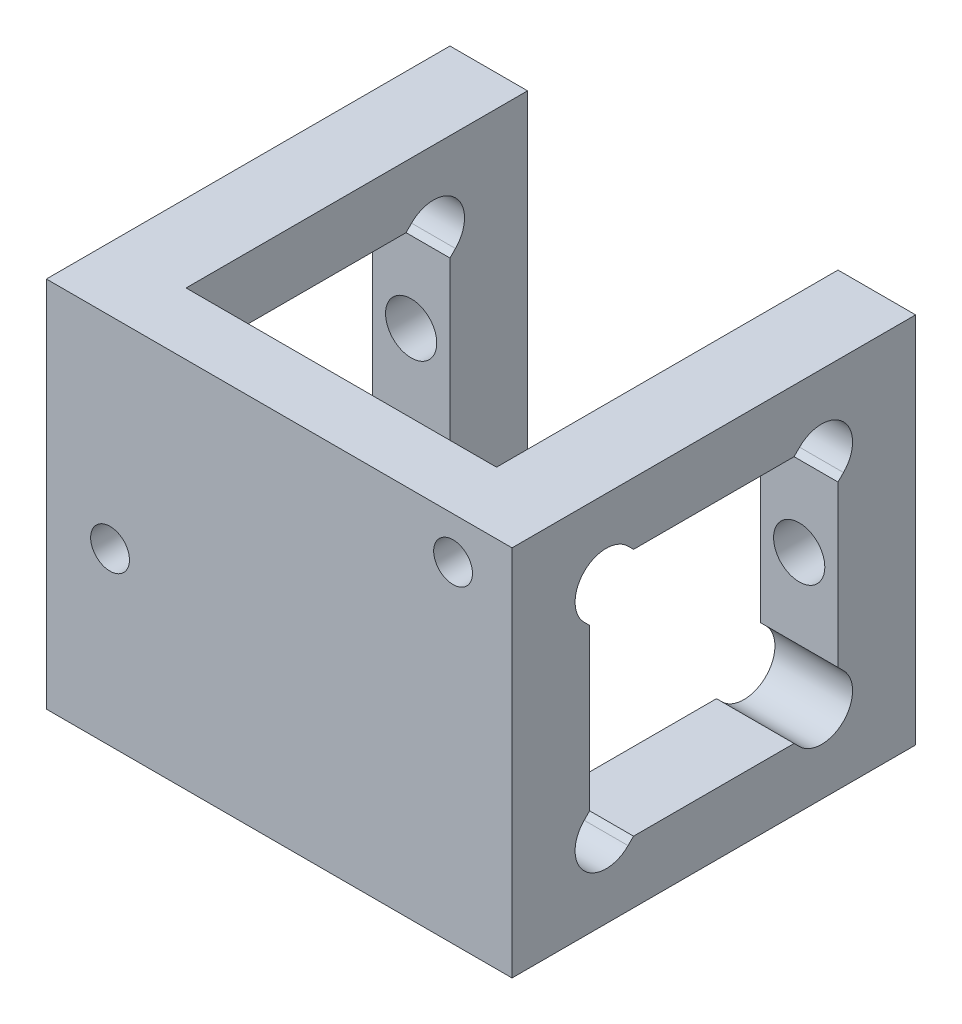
ISO-10303-21;
HEADER;
FILE_DESCRIPTION(('STEP AP214'),'2;1');
FILE_NAME('part.step','',(''),(''),'','','');
FILE_SCHEMA(('AUTOMOTIVE_DESIGN { 1 0 10303 214 1 1 1 1 }'));
ENDSEC;
DATA;
#1=APPLICATION_CONTEXT('core data for automotive mechanical design processes');
#2=APPLICATION_PROTOCOL_DEFINITION('international standard','automotive_design',2000,#1);
#3=PRODUCT_CONTEXT('',#1,'mechanical');
#4=PRODUCT('Part','Part','',(#3));
#5=PRODUCT_RELATED_PRODUCT_CATEGORY('part','',(#4));
#6=PRODUCT_DEFINITION_FORMATION('','',#4);
#7=PRODUCT_DEFINITION_CONTEXT('part definition',#1,'design');
#8=PRODUCT_DEFINITION('design','',#6,#7);
#9=PRODUCT_DEFINITION_SHAPE('','',#8);
#10=(LENGTH_UNIT() NAMED_UNIT(*) SI_UNIT(.MILLI.,.METRE.));
#11=(NAMED_UNIT(*) PLANE_ANGLE_UNIT() SI_UNIT($,.RADIAN.));
#12=(NAMED_UNIT(*) SI_UNIT($,.STERADIAN.) SOLID_ANGLE_UNIT());
#13=UNCERTAINTY_MEASURE_WITH_UNIT(LENGTH_MEASURE(1.E-05),#10,'distance_accuracy_value','');
#14=(GEOMETRIC_REPRESENTATION_CONTEXT(3) GLOBAL_UNCERTAINTY_ASSIGNED_CONTEXT((#13)) GLOBAL_UNIT_ASSIGNED_CONTEXT((#10,
#11,#12)) REPRESENTATION_CONTEXT('',''));
#15=CARTESIAN_POINT('',(0.,0.,0.));
#16=DIRECTION('',(0.,0.,1.));
#17=DIRECTION('',(1.,0.,0.));
#18=AXIS2_PLACEMENT_3D('',#15,#16,#17);
#19=CARTESIAN_POINT('',(0.,-24.,9.));
#20=DIRECTION('',(0.,0.,1.));
#21=DIRECTION('',(1.,0.,0.));
#22=AXIS2_PLACEMENT_3D('',#19,#20,#21);
#23=PLANE('',#22);
#24=DIRECTION('',(0.,-1.,0.));
#25=VECTOR('',#24,1.);
#26=CARTESIAN_POINT('',(25.,0.,8.99999999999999));
#27=LINE('',#26,#25);
#28=CARTESIAN_POINT('',(25.,0.,9.));
#29=VERTEX_POINT('',#28);
#30=CARTESIAN_POINT('',(25.,-2.35000000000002,9.));
#31=VERTEX_POINT('',#30);
#32=EDGE_CURVE('E724',#29,#31,#27,.T.);
#33=ORIENTED_EDGE('',*,*,#32,.T.);
#34=CARTESIAN_POINT('',(26.2,-2.7,9.));
#35=DIRECTION('',(0.,0.,1.));
#36=DIRECTION('',(1.,0.,0.));
#37=AXIS2_PLACEMENT_3D('',#34,#35,#36);
#38=CIRCLE('',#37,1.25);
#39=CARTESIAN_POINT('',(25.,-3.04999999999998,8.99999999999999));
#40=VERTEX_POINT('',#39);
#41=EDGE_CURVE('E959',#31,#40,#38,.T.);
#42=ORIENTED_EDGE('',*,*,#41,.T.);
#43=CARTESIAN_POINT('',(25.,-24.,8.99999999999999));
#44=VERTEX_POINT('',#43);
#45=EDGE_CURVE('E723',#40,#44,#27,.T.);
#46=ORIENTED_EDGE('',*,*,#45,.T.);
#47=DIRECTION('',(1.,0.,0.));
#48=VECTOR('',#47,1.);
#49=CARTESIAN_POINT('',(0.,-24.,9.));
#50=LINE('',#49,#48);
#51=CARTESIAN_POINT('',(5.,-24.,8.99999999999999));
#52=VERTEX_POINT('',#51);
#53=EDGE_CURVE('E402',#52,#44,#50,.T.);
#54=ORIENTED_EDGE('',*,*,#53,.F.);
#55=DIRECTION('',(0.,-1.,0.));
#56=VECTOR('',#55,1.);
#57=CARTESIAN_POINT('',(5.,-24.,9.));
#58=LINE('',#57,#56);
#59=CARTESIAN_POINT('',(5.,-13.8674675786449,8.99999999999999));
#60=VERTEX_POINT('',#59);
#61=EDGE_CURVE('E375',#60,#52,#58,.T.);
#62=ORIENTED_EDGE('',*,*,#61,.F.);
#63=CARTESIAN_POINT('',(4.1,-13.,9.));
#64=DIRECTION('',(0.,0.,1.));
#65=DIRECTION('',(1.,0.,0.));
#66=AXIS2_PLACEMENT_3D('',#63,#64,#65);
#67=CIRCLE('',#66,1.25);
#68=CARTESIAN_POINT('',(5.,-12.1325324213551,8.99999999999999));
#69=VERTEX_POINT('',#68);
#70=EDGE_CURVE('E831',#60,#69,#67,.T.);
#71=ORIENTED_EDGE('',*,*,#70,.T.);
#72=CARTESIAN_POINT('',(5.,0.,8.99999999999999));
#73=VERTEX_POINT('',#72);
#74=EDGE_CURVE('E419',#73,#69,#58,.T.);
#75=ORIENTED_EDGE('',*,*,#74,.F.);
#76=DIRECTION('',(-1.,0.,0.));
#77=VECTOR('',#76,1.);
#78=CARTESIAN_POINT('',(0.,0.,9.));
#79=LINE('',#78,#77);
#80=EDGE_CURVE('E406',#29,#73,#79,.T.);
#81=ORIENTED_EDGE('',*,*,#80,.F.);
#82=EDGE_LOOP('',(#33,#42,#46,#54,#62,#71,#75,#81));
#83=FACE_BOUND('',#82,.T.);
#84=ADVANCED_FACE('F34',(#83),#23,.F.);
#85=CARTESIAN_POINT('',(0.,0.,13.));
#86=DIRECTION('',(1.,0.,0.));
#87=DIRECTION('',(0.,1.,0.));
#88=AXIS2_PLACEMENT_3D('',#85,#86,#87);
#89=PLANE('',#88);
#90=DIRECTION('',(0.,0.,-1.));
#91=VECTOR('',#90,1.);
#92=CARTESIAN_POINT('',(0.,0.,13.));
#93=LINE('',#92,#91);
#94=CARTESIAN_POINT('',(0.,0.,13.));
#95=VERTEX_POINT('',#94);
#96=CARTESIAN_POINT('',(0.,0.,-13.));
#97=VERTEX_POINT('',#96);
#98=EDGE_CURVE('E391',#95,#97,#93,.T.);
#99=ORIENTED_EDGE('',*,*,#98,.T.);
#100=DIRECTION('',(0.,-1.,0.));
#101=VECTOR('',#100,1.);
#102=CARTESIAN_POINT('',(0.,0.,-13.));
#103=LINE('',#102,#101);
#104=CARTESIAN_POINT('',(0.,-24.,-13.));
#105=VERTEX_POINT('',#104);
#106=EDGE_CURVE('E383',#97,#105,#103,.T.);
#107=ORIENTED_EDGE('',*,*,#106,.T.);
#108=DIRECTION('',(0.,0.,-1.));
#109=VECTOR('',#108,1.);
#110=CARTESIAN_POINT('',(0.,-24.,13.));
#111=LINE('',#110,#109);
#112=CARTESIAN_POINT('',(0.,-24.,13.));
#113=VERTEX_POINT('',#112);
#114=EDGE_CURVE('E365',#113,#105,#111,.T.);
#115=ORIENTED_EDGE('',*,*,#114,.F.);
#116=DIRECTION('',(0.,-1.,0.));
#117=VECTOR('',#116,1.);
#118=CARTESIAN_POINT('',(0.,0.,13.));
#119=LINE('',#118,#117);
#120=EDGE_CURVE('E404',#95,#113,#119,.T.);
#121=ORIENTED_EDGE('',*,*,#120,.F.);
#122=EDGE_LOOP('',(#99,#107,#115,#121));
#123=FACE_BOUND('',#122,.T.);
#124=CARTESIAN_POINT('',(0.,-18.9383398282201,-6.93833982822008));
#125=DIRECTION('',(-1.,0.,0.));
#126=DIRECTION('',(0.,0.,1.));
#127=AXIS2_PLACEMENT_3D('',#124,#125,#126);
#128=CIRCLE('',#127,2.);
#129=CARTESIAN_POINT('',(0.,-17.524126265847,-8.35255339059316));
#130=VERTEX_POINT('',#129);
#131=CARTESIAN_POINT('',(0.,-20.3525533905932,-5.524126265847));
#132=VERTEX_POINT('',#131);
#133=EDGE_CURVE('E735',#130,#132,#128,.T.);
#134=ORIENTED_EDGE('',*,*,#133,.F.);
#135=DIRECTION('',(0.,-0.70710678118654,-0.707106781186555));
#136=VECTOR('',#135,1.);
#137=CARTESIAN_POINT('',(0.,-17.524126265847,-8.35255339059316));
#138=LINE('',#137,#136);
#139=CARTESIAN_POINT('',(0.,-17.1715728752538,-8.));
#140=VERTEX_POINT('',#139);
#141=EDGE_CURVE('E742',#140,#130,#138,.T.);
#142=ORIENTED_EDGE('',*,*,#141,.F.);
#143=DIRECTION('',(0.,-1.,0.));
#144=VECTOR('',#143,1.);
#145=CARTESIAN_POINT('',(0.,-4.,-8.));
#146=LINE('',#145,#144);
#147=CARTESIAN_POINT('',(0.,-6.82842712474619,-8.));
#148=VERTEX_POINT('',#147);
#149=EDGE_CURVE('E809',#148,#140,#146,.T.);
#150=ORIENTED_EDGE('',*,*,#149,.F.);
#151=DIRECTION('',(0.,-0.707106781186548,0.707106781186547));
#152=VECTOR('',#151,1.);
#153=CARTESIAN_POINT('',(0.,-6.47487373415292,-8.35355339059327));
#154=LINE('',#153,#152);
#155=CARTESIAN_POINT('',(0.,-6.47487373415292,-8.35355339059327));
#156=VERTEX_POINT('',#155);
#157=EDGE_CURVE('E794',#156,#148,#154,.T.);
#158=ORIENTED_EDGE('',*,*,#157,.F.);
#159=CARTESIAN_POINT('',(0.,-5.06066017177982,-6.93933982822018));
#160=DIRECTION('',(-1.,0.,0.));
#161=DIRECTION('',(0.,0.,1.));
#162=AXIS2_PLACEMENT_3D('',#159,#160,#161);
#163=CIRCLE('',#162,2.);
#164=CARTESIAN_POINT('',(0.,-3.64644660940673,-5.52512626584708));
#165=VERTEX_POINT('',#164);
#166=EDGE_CURVE('E791',#165,#156,#163,.T.);
#167=ORIENTED_EDGE('',*,*,#166,.F.);
#168=DIRECTION('',(0.,0.707106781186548,-0.707106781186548));
#169=VECTOR('',#168,1.);
#170=CARTESIAN_POINT('',(0.,-3.64644660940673,-5.52512626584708));
#171=LINE('',#170,#169);
#172=CARTESIAN_POINT('',(0.,-4.,-5.17157287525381));
#173=VERTEX_POINT('',#172);
#174=EDGE_CURVE('E796',#173,#165,#171,.T.);
#175=ORIENTED_EDGE('',*,*,#174,.F.);
#176=DIRECTION('',(0.,0.,-1.));
#177=VECTOR('',#176,1.);
#178=CARTESIAN_POINT('',(0.,-4.,-8.));
#179=LINE('',#178,#177);
#180=CARTESIAN_POINT('',(0.,-4.,5.16957287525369));
#181=VERTEX_POINT('',#180);
#182=EDGE_CURVE('E814',#181,#173,#179,.T.);
#183=ORIENTED_EDGE('',*,*,#182,.F.);
#184=DIRECTION('',(0.,-0.707106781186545,-0.70710678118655));
#185=VECTOR('',#184,1.);
#186=CARTESIAN_POINT('',(0.,-3.64544660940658,5.52412626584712));
#187=LINE('',#186,#185);
#188=CARTESIAN_POINT('',(0.,-3.64544660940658,5.52412626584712));
#189=VERTEX_POINT('',#188);
#190=EDGE_CURVE('E776',#189,#181,#187,.T.);
#191=ORIENTED_EDGE('',*,*,#190,.F.);
#192=CARTESIAN_POINT('',(0.,-5.05966017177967,6.93833982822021));
#193=DIRECTION('',(-1.,0.,0.));
#194=DIRECTION('',(0.,0.,1.));
#195=AXIS2_PLACEMENT_3D('',#192,#193,#194);
#196=CIRCLE('',#195,2.);
#197=CARTESIAN_POINT('',(0.,-6.47387373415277,8.3525533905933));
#198=VERTEX_POINT('',#197);
#199=EDGE_CURVE('E773',#198,#189,#196,.T.);
#200=ORIENTED_EDGE('',*,*,#199,.F.);
#201=DIRECTION('',(0.,0.707106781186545,0.70710678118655));
#202=VECTOR('',#201,1.);
#203=CARTESIAN_POINT('',(0.,-6.47387373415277,8.3525533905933));
#204=LINE('',#203,#202);
#205=CARTESIAN_POINT('',(0.,-6.82642712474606,8.));
#206=VERTEX_POINT('',#205);
#207=EDGE_CURVE('E778',#206,#198,#204,.T.);
#208=ORIENTED_EDGE('',*,*,#207,.F.);
#209=DIRECTION('',(0.,1.,0.));
#210=VECTOR('',#209,1.);
#211=CARTESIAN_POINT('',(0.,-4.,8.));
#212=LINE('',#211,#210);
#213=CARTESIAN_POINT('',(0.,-17.1695728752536,8.));
#214=VERTEX_POINT('',#213);
#215=EDGE_CURVE('E823',#214,#206,#212,.T.);
#216=ORIENTED_EDGE('',*,*,#215,.F.);
#217=DIRECTION('',(0.,0.707106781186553,-0.707106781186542));
#218=VECTOR('',#217,1.);
#219=CARTESIAN_POINT('',(0.,-17.523126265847,8.35355339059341));
#220=LINE('',#219,#218);
#221=CARTESIAN_POINT('',(0.,-17.523126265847,8.35355339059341));
#222=VERTEX_POINT('',#221);
#223=EDGE_CURVE('E758',#222,#214,#220,.T.);
#224=ORIENTED_EDGE('',*,*,#223,.F.);
#225=CARTESIAN_POINT('',(0.,-18.9373398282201,6.93933982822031));
#226=DIRECTION('',(-1.,0.,0.));
#227=DIRECTION('',(0.,0.,1.));
#228=AXIS2_PLACEMENT_3D('',#225,#226,#227);
#229=CIRCLE('',#228,2.);
#230=CARTESIAN_POINT('',(0.,-20.3515533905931,5.5251262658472));
#231=VERTEX_POINT('',#230);
#232=EDGE_CURVE('E755',#231,#222,#229,.T.);
#233=ORIENTED_EDGE('',*,*,#232,.F.);
#234=DIRECTION('',(0.,-0.707106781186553,0.707106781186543));
#235=VECTOR('',#234,1.);
#236=CARTESIAN_POINT('',(0.,-20.3515533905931,5.5251262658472));
#237=LINE('',#236,#235);
#238=CARTESIAN_POINT('',(0.,-20.,5.17357287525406));
#239=VERTEX_POINT('',#238);
#240=EDGE_CURVE('E760',#239,#231,#237,.T.);
#241=ORIENTED_EDGE('',*,*,#240,.F.);
#242=DIRECTION('',(0.,0.,1.));
#243=VECTOR('',#242,1.);
#244=CARTESIAN_POINT('',(0.,-20.,-8.));
#245=LINE('',#244,#243);
#246=CARTESIAN_POINT('',(0.,-20.,-5.17157287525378));
#247=VERTEX_POINT('',#246);
#248=EDGE_CURVE('E821',#247,#239,#245,.T.);
#249=ORIENTED_EDGE('',*,*,#248,.F.);
#250=DIRECTION('',(0.,0.70710678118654,0.707106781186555));
#251=VECTOR('',#250,1.);
#252=CARTESIAN_POINT('',(0.,-20.3525533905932,-5.524126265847));
#253=LINE('',#252,#251);
#254=EDGE_CURVE('E740',#132,#247,#253,.T.);
#255=ORIENTED_EDGE('',*,*,#254,.F.);
#256=EDGE_LOOP('',(#134,#142,#150,#158,#167,#175,#183,#191,#200,#208,#216,#224,#233,#241,#249,#255));
#257=FACE_BOUND('',#256,.T.);
#258=ADVANCED_FACE('F36',(#123,#257),#89,.F.);
#259=CARTESIAN_POINT('',(0.,-24.,13.));
#260=DIRECTION('',(0.,1.,0.));
#261=DIRECTION('',(0.,0.,1.));
#262=AXIS2_PLACEMENT_3D('',#259,#260,#261);
#263=PLANE('',#262);
#264=ORIENTED_EDGE('',*,*,#114,.T.);
#265=DIRECTION('',(-1.,0.,0.));
#266=VECTOR('',#265,1.);
#267=CARTESIAN_POINT('',(5.,-24.,-13.));
#268=LINE('',#267,#266);
#269=CARTESIAN_POINT('',(5.,-24.,-13.));
#270=VERTEX_POINT('',#269);
#271=EDGE_CURVE('E368',#270,#105,#268,.T.);
#272=ORIENTED_EDGE('',*,*,#271,.F.);
#273=DIRECTION('',(0.,0.,1.));
#274=VECTOR('',#273,1.);
#275=CARTESIAN_POINT('',(5.,-24.,-13.));
#276=LINE('',#275,#274);
#277=EDGE_CURVE('E395',#270,#52,#276,.T.);
#278=ORIENTED_EDGE('',*,*,#277,.T.);
#279=ORIENTED_EDGE('',*,*,#53,.T.);
#280=DIRECTION('',(0.,0.,-1.));
#281=VECTOR('',#280,1.);
#282=CARTESIAN_POINT('',(25.,-24.,8.99999999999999));
#283=LINE('',#282,#281);
#284=CARTESIAN_POINT('',(25.,-24.,-13.));
#285=VERTEX_POINT('',#284);
#286=EDGE_CURVE('E726',#44,#285,#283,.T.);
#287=ORIENTED_EDGE('',*,*,#286,.T.);
#288=DIRECTION('',(1.,0.,0.));
#289=VECTOR('',#288,1.);
#290=CARTESIAN_POINT('',(25.,-24.,-13.));
#291=LINE('',#290,#289);
#292=CARTESIAN_POINT('',(30.,-24.,-13.));
#293=VERTEX_POINT('',#292);
#294=EDGE_CURVE('E732',#285,#293,#291,.T.);
#295=ORIENTED_EDGE('',*,*,#294,.T.);
#296=DIRECTION('',(0.,0.,-1.));
#297=VECTOR('',#296,1.);
#298=CARTESIAN_POINT('',(30.,-24.,13.));
#299=LINE('',#298,#297);
#300=CARTESIAN_POINT('',(30.,-24.,13.));
#301=VERTEX_POINT('',#300);
#302=EDGE_CURVE('E376',#301,#293,#299,.T.);
#303=ORIENTED_EDGE('',*,*,#302,.F.);
#304=DIRECTION('',(1.,0.,0.));
#305=VECTOR('',#304,1.);
#306=CARTESIAN_POINT('',(0.,-24.,13.));
#307=LINE('',#306,#305);
#308=EDGE_CURVE('E371',#113,#301,#307,.T.);
#309=ORIENTED_EDGE('',*,*,#308,.F.);
#310=EDGE_LOOP('',(#264,#272,#278,#279,#287,#295,#303,#309));
#311=FACE_BOUND('',#310,.T.);
#312=ADVANCED_FACE('F346',(#311),#263,.F.);
#313=CARTESIAN_POINT('',(30.,0.,13.));
#314=DIRECTION('',(-1.,0.,0.));
#315=DIRECTION('',(0.,-1.,0.));
#316=AXIS2_PLACEMENT_3D('',#313,#314,#315);
#317=PLANE('',#316);
#318=ORIENTED_EDGE('',*,*,#302,.T.);
#319=DIRECTION('',(0.,1.,0.));
#320=VECTOR('',#319,1.);
#321=CARTESIAN_POINT('',(30.,-24.,-13.));
#322=LINE('',#321,#320);
#323=CARTESIAN_POINT('',(30.,0.,-13.));
#324=VERTEX_POINT('',#323);
#325=EDGE_CURVE('E685',#293,#324,#322,.T.);
#326=ORIENTED_EDGE('',*,*,#325,.T.);
#327=DIRECTION('',(0.,0.,-1.));
#328=VECTOR('',#327,1.);
#329=CARTESIAN_POINT('',(30.,0.,13.));
#330=LINE('',#329,#328);
#331=CARTESIAN_POINT('',(30.,0.,13.));
#332=VERTEX_POINT('',#331);
#333=EDGE_CURVE('E416',#332,#324,#330,.T.);
#334=ORIENTED_EDGE('',*,*,#333,.F.);
#335=DIRECTION('',(0.,1.,0.));
#336=VECTOR('',#335,1.);
#337=CARTESIAN_POINT('',(30.,0.,13.));
#338=LINE('',#337,#336);
#339=EDGE_CURVE('E408',#301,#332,#338,.T.);
#340=ORIENTED_EDGE('',*,*,#339,.F.);
#341=EDGE_LOOP('',(#318,#326,#334,#340));
#342=FACE_BOUND('',#341,.T.);
#343=CARTESIAN_POINT('',(30.,-5.06066017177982,-6.93933982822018));
#344=DIRECTION('',(1.,0.,0.));
#345=DIRECTION('',(0.,1.,0.));
#346=AXIS2_PLACEMENT_3D('',#343,#344,#345);
#347=CIRCLE('',#346,2.);
#348=CARTESIAN_POINT('',(30.,-6.47487373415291,-8.35355339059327));
#349=VERTEX_POINT('',#348);
#350=CARTESIAN_POINT('',(30.,-3.64644660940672,-5.52512626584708));
#351=VERTEX_POINT('',#350);
#352=EDGE_CURVE('E581',#349,#351,#347,.T.);
#353=ORIENTED_EDGE('',*,*,#352,.F.);
#354=DIRECTION('',(0.,0.707106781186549,-0.707106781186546));
#355=VECTOR('',#354,1.);
#356=CARTESIAN_POINT('',(30.,-6.47487373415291,-8.35355339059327));
#357=LINE('',#356,#355);
#358=CARTESIAN_POINT('',(30.,-6.82842712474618,-8.));
#359=VERTEX_POINT('',#358);
#360=EDGE_CURVE('E592',#359,#349,#357,.T.);
#361=ORIENTED_EDGE('',*,*,#360,.F.);
#362=DIRECTION('',(0.,1.,0.));
#363=VECTOR('',#362,1.);
#364=CARTESIAN_POINT('',(30.,-6.82842712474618,-8.));
#365=LINE('',#364,#363);
#366=CARTESIAN_POINT('',(30.,-17.1715728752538,-8.));
#367=VERTEX_POINT('',#366);
#368=EDGE_CURVE('E678',#367,#359,#365,.T.);
#369=ORIENTED_EDGE('',*,*,#368,.F.);
#370=DIRECTION('',(0.,0.707106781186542,0.707106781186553));
#371=VECTOR('',#370,1.);
#372=CARTESIAN_POINT('',(30.,-17.524126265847,-8.35255339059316));
#373=LINE('',#372,#371);
#374=CARTESIAN_POINT('',(30.,-17.524126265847,-8.35255339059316));
#375=VERTEX_POINT('',#374);
#376=EDGE_CURVE('E675',#375,#367,#373,.T.);
#377=ORIENTED_EDGE('',*,*,#376,.F.);
#378=CARTESIAN_POINT('',(30.,-18.9383398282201,-6.93833982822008));
#379=DIRECTION('',(1.,0.,0.));
#380=DIRECTION('',(0.,1.,0.));
#381=AXIS2_PLACEMENT_3D('',#378,#379,#380);
#382=CIRCLE('',#381,2.);
#383=CARTESIAN_POINT('',(30.,-20.3525533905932,-5.524126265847));
#384=VERTEX_POINT('',#383);
#385=EDGE_CURVE('E672',#384,#375,#382,.T.);
#386=ORIENTED_EDGE('',*,*,#385,.F.);
#387=DIRECTION('',(0.,-0.70710678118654,-0.707106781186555));
#388=VECTOR('',#387,1.);
#389=CARTESIAN_POINT('',(30.,-20.3525533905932,-5.524126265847));
#390=LINE('',#389,#388);
#391=CARTESIAN_POINT('',(30.,-20.,-5.17157287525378));
#392=VERTEX_POINT('',#391);
#393=EDGE_CURVE('E669',#392,#384,#390,.T.);
#394=ORIENTED_EDGE('',*,*,#393,.F.);
#395=DIRECTION('',(0.,0.,-1.));
#396=VECTOR('',#395,1.);
#397=CARTESIAN_POINT('',(30.,-20.,-5.17157287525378));
#398=LINE('',#397,#396);
#399=CARTESIAN_POINT('',(30.,-20.,5.17357287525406));
#400=VERTEX_POINT('',#399);
#401=EDGE_CURVE('E666',#400,#392,#398,.T.);
#402=ORIENTED_EDGE('',*,*,#401,.F.);
#403=DIRECTION('',(0.,0.707106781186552,-0.707106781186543));
#404=VECTOR('',#403,1.);
#405=CARTESIAN_POINT('',(30.,-20.3515533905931,5.5251262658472));
#406=LINE('',#405,#404);
#407=CARTESIAN_POINT('',(30.,-20.3515533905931,5.5251262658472));
#408=VERTEX_POINT('',#407);
#409=EDGE_CURVE('E663',#408,#400,#406,.T.);
#410=ORIENTED_EDGE('',*,*,#409,.F.);
#411=CARTESIAN_POINT('',(30.,-18.9373398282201,6.93933982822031));
#412=DIRECTION('',(1.,0.,0.));
#413=DIRECTION('',(0.,1.,0.));
#414=AXIS2_PLACEMENT_3D('',#411,#412,#413);
#415=CIRCLE('',#414,2.);
#416=CARTESIAN_POINT('',(30.,-17.523126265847,8.35355339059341));
#417=VERTEX_POINT('',#416);
#418=EDGE_CURVE('E660',#417,#408,#415,.T.);
#419=ORIENTED_EDGE('',*,*,#418,.F.);
#420=DIRECTION('',(0.,-0.707106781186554,0.707106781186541));
#421=VECTOR('',#420,1.);
#422=CARTESIAN_POINT('',(30.,-17.523126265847,8.35355339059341));
#423=LINE('',#422,#421);
#424=CARTESIAN_POINT('',(30.,-17.1695728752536,8.));
#425=VERTEX_POINT('',#424);
#426=EDGE_CURVE('E657',#425,#417,#423,.T.);
#427=ORIENTED_EDGE('',*,*,#426,.F.);
#428=DIRECTION('',(0.,-1.,0.));
#429=VECTOR('',#428,1.);
#430=CARTESIAN_POINT('',(30.,-6.82642712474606,8.));
#431=LINE('',#430,#429);
#432=CARTESIAN_POINT('',(30.,-6.82642712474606,8.));
#433=VERTEX_POINT('',#432);
#434=EDGE_CURVE('E654',#433,#425,#431,.T.);
#435=ORIENTED_EDGE('',*,*,#434,.F.);
#436=DIRECTION('',(0.,-0.707106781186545,-0.70710678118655));
#437=VECTOR('',#436,1.);
#438=CARTESIAN_POINT('',(30.,-6.47387373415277,8.3525533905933));
#439=LINE('',#438,#437);
#440=CARTESIAN_POINT('',(30.,-6.47387373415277,8.3525533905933));
#441=VERTEX_POINT('',#440);
#442=EDGE_CURVE('E651',#441,#433,#439,.T.);
#443=ORIENTED_EDGE('',*,*,#442,.F.);
#444=CARTESIAN_POINT('',(30.,-5.05966017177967,6.93833982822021));
#445=DIRECTION('',(1.,0.,0.));
#446=DIRECTION('',(0.,1.,0.));
#447=AXIS2_PLACEMENT_3D('',#444,#445,#446);
#448=CIRCLE('',#447,2.);
#449=CARTESIAN_POINT('',(30.,-3.64544660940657,5.52412626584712));
#450=VERTEX_POINT('',#449);
#451=EDGE_CURVE('E648',#450,#441,#448,.T.);
#452=ORIENTED_EDGE('',*,*,#451,.F.);
#453=DIRECTION('',(0.,0.707106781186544,0.70710678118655));
#454=VECTOR('',#453,1.);
#455=CARTESIAN_POINT('',(30.,-3.64544660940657,5.52412626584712));
#456=LINE('',#455,#454);
#457=CARTESIAN_POINT('',(30.,-4.,5.16957287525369));
#458=VERTEX_POINT('',#457);
#459=EDGE_CURVE('E645',#458,#450,#456,.T.);
#460=ORIENTED_EDGE('',*,*,#459,.F.);
#461=DIRECTION('',(0.,0.,1.));
#462=VECTOR('',#461,1.);
#463=CARTESIAN_POINT('',(30.,-4.,-5.17157287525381));
#464=LINE('',#463,#462);
#465=CARTESIAN_POINT('',(30.,-4.,-5.17157287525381));
#466=VERTEX_POINT('',#465);
#467=EDGE_CURVE('E642',#466,#458,#464,.T.);
#468=ORIENTED_EDGE('',*,*,#467,.F.);
#469=DIRECTION('',(0.,-0.707106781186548,0.707106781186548));
#470=VECTOR('',#469,1.);
#471=CARTESIAN_POINT('',(30.,-3.64644660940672,-5.52512626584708));
#472=LINE('',#471,#470);
#473=EDGE_CURVE('E639',#351,#466,#472,.T.);
#474=ORIENTED_EDGE('',*,*,#473,.F.);
#475=EDGE_LOOP('',(#353,#361,#369,#377,#386,#394,#402,#410,#419,#427,#435,#443,#452,#460,#468,#474));
#476=FACE_BOUND('',#475,.T.);
#477=ADVANCED_FACE('F356',(#342,#476),#317,.F.);
#478=CARTESIAN_POINT('',(0.,0.,13.));
#479=DIRECTION('',(0.,-1.,0.));
#480=DIRECTION('',(0.,0.,-1.));
#481=AXIS2_PLACEMENT_3D('',#478,#479,#480);
#482=PLANE('',#481);
#483=ORIENTED_EDGE('',*,*,#98,.F.);
#484=DIRECTION('',(-1.,0.,0.));
#485=VECTOR('',#484,1.);
#486=CARTESIAN_POINT('',(0.,0.,13.));
#487=LINE('',#486,#485);
#488=EDGE_CURVE('E410',#332,#95,#487,.T.);
#489=ORIENTED_EDGE('',*,*,#488,.F.);
#490=ORIENTED_EDGE('',*,*,#333,.T.);
#491=DIRECTION('',(1.,0.,0.));
#492=VECTOR('',#491,1.);
#493=CARTESIAN_POINT('',(25.,0.,-13.));
#494=LINE('',#493,#492);
#495=CARTESIAN_POINT('',(25.,0.,-13.));
#496=VERTEX_POINT('',#495);
#497=EDGE_CURVE('E729',#496,#324,#494,.T.);
#498=ORIENTED_EDGE('',*,*,#497,.F.);
#499=DIRECTION('',(0.,0.,1.));
#500=VECTOR('',#499,1.);
#501=CARTESIAN_POINT('',(25.,0.,-13.));
#502=LINE('',#501,#500);
#503=EDGE_CURVE('E721',#496,#29,#502,.T.);
#504=ORIENTED_EDGE('',*,*,#503,.T.);
#505=ORIENTED_EDGE('',*,*,#80,.T.);
#506=DIRECTION('',(0.,0.,-1.));
#507=VECTOR('',#506,1.);
#508=CARTESIAN_POINT('',(5.,0.,-13.));
#509=LINE('',#508,#507);
#510=CARTESIAN_POINT('',(5.,0.,-13.));
#511=VERTEX_POINT('',#510);
#512=EDGE_CURVE('E387',#73,#511,#509,.T.);
#513=ORIENTED_EDGE('',*,*,#512,.T.);
#514=DIRECTION('',(-1.,0.,0.));
#515=VECTOR('',#514,1.);
#516=CARTESIAN_POINT('',(5.,0.,-13.));
#517=LINE('',#516,#515);
#518=EDGE_CURVE('E386',#511,#97,#517,.T.);
#519=ORIENTED_EDGE('',*,*,#518,.T.);
#520=EDGE_LOOP('',(#483,#489,#490,#498,#504,#505,#513,#519));
#521=FACE_BOUND('',#520,.T.);
#522=ADVANCED_FACE('F353',(#521),#482,.F.);
#523=CARTESIAN_POINT('',(0.,-24.,13.));
#524=DIRECTION('',(0.,0.,1.));
#525=DIRECTION('',(1.,0.,0.));
#526=AXIS2_PLACEMENT_3D('',#523,#524,#525);
#527=PLANE('',#526);
#528=CARTESIAN_POINT('',(26.2,-2.7,13.));
#529=DIRECTION('',(0.,0.,1.));
#530=DIRECTION('',(1.,0.,0.));
#531=AXIS2_PLACEMENT_3D('',#528,#529,#530);
#532=CIRCLE('',#531,1.25);
#533=CARTESIAN_POINT('',(27.45,-2.7,13.));
#534=VERTEX_POINT('',#533);
#535=EDGE_CURVE('E961',#534,#534,#532,.T.);
#536=ORIENTED_EDGE('',*,*,#535,.F.);
#537=EDGE_LOOP('',(#536));
#538=FACE_BOUND('',#537,.T.);
#539=CARTESIAN_POINT('',(4.1,-13.,13.));
#540=DIRECTION('',(0.,0.,1.));
#541=DIRECTION('',(1.,0.,0.));
#542=AXIS2_PLACEMENT_3D('',#539,#540,#541);
#543=CIRCLE('',#542,1.25);
#544=CARTESIAN_POINT('',(5.35,-13.,13.));
#545=VERTEX_POINT('',#544);
#546=EDGE_CURVE('E888',#545,#545,#543,.T.);
#547=ORIENTED_EDGE('',*,*,#546,.F.);
#548=EDGE_LOOP('',(#547));
#549=FACE_BOUND('',#548,.T.);
#550=ORIENTED_EDGE('',*,*,#308,.T.);
#551=ORIENTED_EDGE('',*,*,#339,.T.);
#552=ORIENTED_EDGE('',*,*,#488,.T.);
#553=ORIENTED_EDGE('',*,*,#120,.T.);
#554=EDGE_LOOP('',(#550,#551,#552,#553));
#555=FACE_BOUND('',#554,.T.);
#556=ADVANCED_FACE('F351',(#538,#549,#555),#527,.T.);
#557=CARTESIAN_POINT('',(5.,-24.,-13.));
#558=DIRECTION('',(-1.,0.,0.));
#559=DIRECTION('',(0.,0.,1.));
#560=AXIS2_PLACEMENT_3D('',#557,#558,#559);
#561=PLANE('',#560);
#562=DIRECTION('',(0.,1.,0.));
#563=VECTOR('',#562,1.);
#564=CARTESIAN_POINT('',(5.,-4.,8.));
#565=LINE('',#564,#563);
#566=CARTESIAN_POINT('',(5.,-17.1695728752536,8.));
#567=VERTEX_POINT('',#566);
#568=CARTESIAN_POINT('',(5.,-13.8674675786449,8.));
#569=VERTEX_POINT('',#568);
#570=EDGE_CURVE('E397',#567,#569,#565,.T.);
#571=ORIENTED_EDGE('',*,*,#570,.T.);
#572=DIRECTION('',(0.,0.,1.));
#573=VECTOR('',#572,1.);
#574=CARTESIAN_POINT('',(5.,-13.8674675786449,13.));
#575=LINE('',#574,#573);
#576=EDGE_CURVE('E461',#569,#60,#575,.T.);
#577=ORIENTED_EDGE('',*,*,#576,.T.);
#578=ORIENTED_EDGE('',*,*,#61,.T.);
#579=ORIENTED_EDGE('',*,*,#277,.F.);
#580=DIRECTION('',(0.,-1.,0.));
#581=VECTOR('',#580,1.);
#582=CARTESIAN_POINT('',(5.,0.,-13.));
#583=LINE('',#582,#581);
#584=EDGE_CURVE('E385',#511,#270,#583,.T.);
#585=ORIENTED_EDGE('',*,*,#584,.F.);
#586=ORIENTED_EDGE('',*,*,#512,.F.);
#587=ORIENTED_EDGE('',*,*,#74,.T.);
#588=DIRECTION('',(0.,0.,1.));
#589=VECTOR('',#588,1.);
#590=CARTESIAN_POINT('',(5.,-12.1325324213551,13.));
#591=LINE('',#590,#589);
#592=CARTESIAN_POINT('',(5.,-12.1325324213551,8.));
#593=VERTEX_POINT('',#592);
#594=EDGE_CURVE('E458',#69,#593,#591,.F.);
#595=ORIENTED_EDGE('',*,*,#594,.T.);
#596=CARTESIAN_POINT('',(5.,-6.82642712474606,8.));
#597=VERTEX_POINT('',#596);
#598=EDGE_CURVE('E816',#593,#597,#565,.T.);
#599=ORIENTED_EDGE('',*,*,#598,.T.);
#600=DIRECTION('',(0.,0.707106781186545,0.70710678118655));
#601=VECTOR('',#600,1.);
#602=CARTESIAN_POINT('',(5.,-25.913213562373,-11.086786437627));
#603=LINE('',#602,#601);
#604=CARTESIAN_POINT('',(5.,-6.47387373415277,8.3525533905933));
#605=VERTEX_POINT('',#604);
#606=EDGE_CURVE('E784',#597,#605,#603,.T.);
#607=ORIENTED_EDGE('',*,*,#606,.T.);
#608=CARTESIAN_POINT('',(5.,-5.05966017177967,6.93833982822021));
#609=DIRECTION('',(-1.,0.,0.));
#610=DIRECTION('',(0.,0.,1.));
#611=AXIS2_PLACEMENT_3D('',#608,#609,#610);
#612=CIRCLE('',#611,2.);
#613=CARTESIAN_POINT('',(5.,-3.64544660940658,5.52412626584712));
#614=VERTEX_POINT('',#613);
#615=EDGE_CURVE('E437',#605,#614,#612,.T.);
#616=ORIENTED_EDGE('',*,*,#615,.T.);
#617=DIRECTION('',(0.,-0.707106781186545,-0.70710678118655));
#618=VECTOR('',#617,1.);
#619=CARTESIAN_POINT('',(5.,-23.0847864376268,-13.9152135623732));
#620=LINE('',#619,#618);
#621=CARTESIAN_POINT('',(5.,-4.,5.16957287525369));
#622=VERTEX_POINT('',#621);
#623=EDGE_CURVE('E788',#614,#622,#620,.T.);
#624=ORIENTED_EDGE('',*,*,#623,.T.);
#625=DIRECTION('',(0.,0.,-1.));
#626=VECTOR('',#625,1.);
#627=CARTESIAN_POINT('',(5.,-4.,-8.));
#628=LINE('',#627,#626);
#629=CARTESIAN_POINT('',(5.,-4.,-5.17157287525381));
#630=VERTEX_POINT('',#629);
#631=EDGE_CURVE('E393',#622,#630,#628,.T.);
#632=ORIENTED_EDGE('',*,*,#631,.T.);
#633=DIRECTION('',(0.,0.707106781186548,-0.707106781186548));
#634=VECTOR('',#633,1.);
#635=CARTESIAN_POINT('',(5.,-10.0857864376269,0.914213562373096));
#636=LINE('',#635,#634);
#637=CARTESIAN_POINT('',(5.,-3.64644660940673,-5.52512626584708));
#638=VERTEX_POINT('',#637);
#639=EDGE_CURVE('E802',#630,#638,#636,.T.);
#640=ORIENTED_EDGE('',*,*,#639,.T.);
#641=CARTESIAN_POINT('',(5.,-5.06066017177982,-6.93933982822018));
#642=DIRECTION('',(-1.,0.,0.));
#643=DIRECTION('',(0.,0.,1.));
#644=AXIS2_PLACEMENT_3D('',#641,#642,#643);
#645=CIRCLE('',#644,2.);
#646=CARTESIAN_POINT('',(5.,-6.47487373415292,-8.35355339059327));
#647=VERTEX_POINT('',#646);
#648=EDGE_CURVE('E428',#638,#647,#645,.T.);
#649=ORIENTED_EDGE('',*,*,#648,.T.);
#650=DIRECTION('',(0.,-0.707106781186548,0.707106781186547));
#651=VECTOR('',#650,1.);
#652=CARTESIAN_POINT('',(5.,-12.9142135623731,-1.91421356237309));
#653=LINE('',#652,#651);
#654=CARTESIAN_POINT('',(5.,-6.82842712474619,-8.));
#655=VERTEX_POINT('',#654);
#656=EDGE_CURVE('E806',#647,#655,#653,.T.);
#657=ORIENTED_EDGE('',*,*,#656,.T.);
#658=DIRECTION('',(0.,-1.,0.));
#659=VECTOR('',#658,1.);
#660=CARTESIAN_POINT('',(5.,-4.,-8.));
#661=LINE('',#660,#659);
#662=CARTESIAN_POINT('',(5.,-17.1715728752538,-8.));
#663=VERTEX_POINT('',#662);
#664=EDGE_CURVE('E810',#655,#663,#661,.T.);
#665=ORIENTED_EDGE('',*,*,#664,.T.);
#666=DIRECTION('',(0.,-0.70710678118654,-0.707106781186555));
#667=VECTOR('',#666,1.);
#668=CARTESIAN_POINT('',(5.,-23.0857864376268,-13.9142135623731));
#669=LINE('',#668,#667);
#670=CARTESIAN_POINT('',(5.,-17.524126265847,-8.35255339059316));
#671=VERTEX_POINT('',#670);
#672=EDGE_CURVE('E752',#663,#671,#669,.T.);
#673=ORIENTED_EDGE('',*,*,#672,.T.);
#674=CARTESIAN_POINT('',(5.,-18.9383398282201,-6.93833982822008));
#675=DIRECTION('',(-1.,0.,0.));
#676=DIRECTION('',(0.,0.,1.));
#677=AXIS2_PLACEMENT_3D('',#674,#675,#676);
#678=CIRCLE('',#677,2.);
#679=CARTESIAN_POINT('',(5.,-20.3525533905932,-5.524126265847));
#680=VERTEX_POINT('',#679);
#681=EDGE_CURVE('E455',#671,#680,#678,.T.);
#682=ORIENTED_EDGE('',*,*,#681,.T.);
#683=DIRECTION('',(0.,0.70710678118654,0.707106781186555));
#684=VECTOR('',#683,1.);
#685=CARTESIAN_POINT('',(5.,-25.9142135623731,-11.085786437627));
#686=LINE('',#685,#684);
#687=CARTESIAN_POINT('',(5.,-20.,-5.17157287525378));
#688=VERTEX_POINT('',#687);
#689=EDGE_CURVE('E748',#680,#688,#686,.T.);
#690=ORIENTED_EDGE('',*,*,#689,.T.);
#691=DIRECTION('',(0.,0.,1.));
#692=VECTOR('',#691,1.);
#693=CARTESIAN_POINT('',(5.,-20.,-8.));
#694=LINE('',#693,#692);
#695=CARTESIAN_POINT('',(5.,-20.,5.17357287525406));
#696=VERTEX_POINT('',#695);
#697=EDGE_CURVE('E813',#688,#696,#694,.T.);
#698=ORIENTED_EDGE('',*,*,#697,.T.);
#699=DIRECTION('',(0.,-0.707106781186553,0.707106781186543));
#700=VECTOR('',#699,1.);
#701=CARTESIAN_POINT('',(5.,-12.913213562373,-1.91321356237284));
#702=LINE('',#701,#700);
#703=CARTESIAN_POINT('',(5.,-20.3515533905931,5.5251262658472));
#704=VERTEX_POINT('',#703);
#705=EDGE_CURVE('E766',#696,#704,#702,.T.);
#706=ORIENTED_EDGE('',*,*,#705,.T.);
#707=CARTESIAN_POINT('',(5.,-18.9373398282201,6.93933982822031));
#708=DIRECTION('',(-1.,0.,0.));
#709=DIRECTION('',(0.,0.,1.));
#710=AXIS2_PLACEMENT_3D('',#707,#708,#709);
#711=CIRCLE('',#710,2.);
#712=CARTESIAN_POINT('',(5.,-17.523126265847,8.35355339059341));
#713=VERTEX_POINT('',#712);
#714=EDGE_CURVE('E446',#704,#713,#711,.T.);
#715=ORIENTED_EDGE('',*,*,#714,.T.);
#716=DIRECTION('',(0.,0.707106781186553,-0.707106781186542));
#717=VECTOR('',#716,1.);
#718=CARTESIAN_POINT('',(5.,-10.0847864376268,0.915213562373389));
#719=LINE('',#718,#717);
#720=EDGE_CURVE('E770',#713,#567,#719,.T.);
#721=ORIENTED_EDGE('',*,*,#720,.T.);
#722=EDGE_LOOP('',(#571,#577,#578,#579,#585,#586,#587,#595,#599,#607,#616,#624,#632,#640,#649,
#657,#665,#673,#682,#690,#698,#706,#715,#721));
#723=FACE_BOUND('',#722,.T.);
#724=ADVANCED_FACE('F566',(#723),#561,.F.);
#725=CARTESIAN_POINT('',(5.,0.,-13.));
#726=DIRECTION('',(0.,0.,-1.));
#727=DIRECTION('',(0.,1.,0.));
#728=AXIS2_PLACEMENT_3D('',#725,#726,#727);
#729=PLANE('',#728);
#730=CARTESIAN_POINT('',(2.5,-12.,-13.));
#731=DIRECTION('',(0.,0.,-1.));
#732=DIRECTION('',(0.,1.,0.));
#733=AXIS2_PLACEMENT_3D('',#730,#731,#732);
#734=CIRCLE('',#733,1.64999999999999);
#735=CARTESIAN_POINT('',(2.5,-10.35,-13.));
#736=VERTEX_POINT('',#735);
#737=EDGE_CURVE('E575',#736,#736,#734,.T.);
#738=ORIENTED_EDGE('',*,*,#737,.F.);
#739=EDGE_LOOP('',(#738));
#740=FACE_BOUND('',#739,.T.);
#741=ORIENTED_EDGE('',*,*,#106,.F.);
#742=ORIENTED_EDGE('',*,*,#518,.F.);
#743=ORIENTED_EDGE('',*,*,#584,.T.);
#744=ORIENTED_EDGE('',*,*,#271,.T.);
#745=EDGE_LOOP('',(#741,#742,#743,#744));
#746=FACE_BOUND('',#745,.T.);
#747=ADVANCED_FACE('F381',(#740,#746),#729,.T.);
#748=CARTESIAN_POINT('',(5.,-4.,-8.));
#749=DIRECTION('',(0.,0.,-1.));
#750=DIRECTION('',(0.,1.,0.));
#751=AXIS2_PLACEMENT_3D('',#748,#749,#750);
#752=PLANE('',#751);
#753=CARTESIAN_POINT('',(2.5,-12.,-8.));
#754=DIRECTION('',(0.,0.,-1.));
#755=DIRECTION('',(0.,1.,0.));
#756=AXIS2_PLACEMENT_3D('',#753,#754,#755);
#757=CIRCLE('',#756,1.64999999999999);
#758=CARTESIAN_POINT('',(2.5,-10.35,-8.));
#759=VERTEX_POINT('',#758);
#760=EDGE_CURVE('E577',#759,#759,#757,.T.);
#761=ORIENTED_EDGE('',*,*,#760,.T.);
#762=EDGE_LOOP('',(#761));
#763=FACE_BOUND('',#762,.T.);
#764=ORIENTED_EDGE('',*,*,#149,.T.);
#765=DIRECTION('',(1.,0.,0.));
#766=VECTOR('',#765,1.);
#767=CARTESIAN_POINT('',(5.,-17.1715728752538,-8.));
#768=LINE('',#767,#766);
#769=EDGE_CURVE('E452',#140,#663,#768,.T.);
#770=ORIENTED_EDGE('',*,*,#769,.T.);
#771=ORIENTED_EDGE('',*,*,#664,.F.);
#772=DIRECTION('',(-1.,0.,0.));
#773=VECTOR('',#772,1.);
#774=CARTESIAN_POINT('',(5.,-6.82842712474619,-8.));
#775=LINE('',#774,#773);
#776=EDGE_CURVE('E425',#655,#148,#775,.T.);
#777=ORIENTED_EDGE('',*,*,#776,.T.);
#778=EDGE_LOOP('',(#764,#770,#771,#777));
#779=FACE_BOUND('',#778,.T.);
#780=ADVANCED_FACE('F555',(#763,#779),#752,.F.);
#781=CARTESIAN_POINT('',(5.,-4.,-8.));
#782=DIRECTION('',(0.,1.,0.));
#783=DIRECTION('',(0.,0.,1.));
#784=AXIS2_PLACEMENT_3D('',#781,#782,#783);
#785=PLANE('',#784);
#786=ORIENTED_EDGE('',*,*,#631,.F.);
#787=DIRECTION('',(-1.,0.,0.));
#788=VECTOR('',#787,1.);
#789=CARTESIAN_POINT('',(5.,-4.,5.16957287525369));
#790=LINE('',#789,#788);
#791=EDGE_CURVE('E434',#622,#181,#790,.T.);
#792=ORIENTED_EDGE('',*,*,#791,.T.);
#793=ORIENTED_EDGE('',*,*,#182,.T.);
#794=DIRECTION('',(1.,0.,0.));
#795=VECTOR('',#794,1.);
#796=CARTESIAN_POINT('',(5.,-4.,-5.17157287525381));
#797=LINE('',#796,#795);
#798=EDGE_CURVE('E422',#173,#630,#797,.T.);
#799=ORIENTED_EDGE('',*,*,#798,.T.);
#800=EDGE_LOOP('',(#786,#792,#793,#799));
#801=FACE_BOUND('',#800,.T.);
#802=ADVANCED_FACE('F551',(#801),#785,.F.);
#803=CARTESIAN_POINT('',(5.,-4.,8.));
#804=DIRECTION('',(0.,0.,1.));
#805=DIRECTION('',(0.,-1.,0.));
#806=AXIS2_PLACEMENT_3D('',#803,#804,#805);
#807=PLANE('',#806);
#808=ORIENTED_EDGE('',*,*,#598,.F.);
#809=CARTESIAN_POINT('',(4.1,-13.,8.));
#810=DIRECTION('',(0.,0.,1.));
#811=DIRECTION('',(0.,-1.,0.));
#812=AXIS2_PLACEMENT_3D('',#809,#810,#811);
#813=CIRCLE('',#812,1.25);
#814=EDGE_CURVE('E854',#593,#569,#813,.T.);
#815=ORIENTED_EDGE('',*,*,#814,.T.);
#816=ORIENTED_EDGE('',*,*,#570,.F.);
#817=DIRECTION('',(-1.,0.,0.));
#818=VECTOR('',#817,1.);
#819=CARTESIAN_POINT('',(5.,-17.1695728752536,8.));
#820=LINE('',#819,#818);
#821=EDGE_CURVE('E443',#567,#214,#820,.T.);
#822=ORIENTED_EDGE('',*,*,#821,.T.);
#823=ORIENTED_EDGE('',*,*,#215,.T.);
#824=DIRECTION('',(1.,0.,0.));
#825=VECTOR('',#824,1.);
#826=CARTESIAN_POINT('',(5.,-6.82642712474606,8.));
#827=LINE('',#826,#825);
#828=EDGE_CURVE('E431',#206,#597,#827,.T.);
#829=ORIENTED_EDGE('',*,*,#828,.T.);
#830=EDGE_LOOP('',(#808,#815,#816,#822,#823,#829));
#831=FACE_BOUND('',#830,.T.);
#832=ADVANCED_FACE('F554',(#831),#807,.F.);
#833=CARTESIAN_POINT('',(5.,-20.,-8.));
#834=DIRECTION('',(0.,-1.,0.));
#835=DIRECTION('',(0.,0.,-1.));
#836=AXIS2_PLACEMENT_3D('',#833,#834,#835);
#837=PLANE('',#836);
#838=ORIENTED_EDGE('',*,*,#697,.F.);
#839=DIRECTION('',(-1.,0.,0.));
#840=VECTOR('',#839,1.);
#841=CARTESIAN_POINT('',(5.,-20.,-5.17157287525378));
#842=LINE('',#841,#840);
#843=EDGE_CURVE('E449',#688,#247,#842,.T.);
#844=ORIENTED_EDGE('',*,*,#843,.T.);
#845=ORIENTED_EDGE('',*,*,#248,.T.);
#846=DIRECTION('',(1.,0.,0.));
#847=VECTOR('',#846,1.);
#848=CARTESIAN_POINT('',(5.,-20.,5.17357287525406));
#849=LINE('',#848,#847);
#850=EDGE_CURVE('E440',#239,#696,#849,.T.);
#851=ORIENTED_EDGE('',*,*,#850,.T.);
#852=EDGE_LOOP('',(#838,#844,#845,#851));
#853=FACE_BOUND('',#852,.T.);
#854=ADVANCED_FACE('F549',(#853),#837,.F.);
#855=CARTESIAN_POINT('',(10.,-5.06066017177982,-6.93933982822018));
#856=DIRECTION('',(-1.,0.,0.));
#857=DIRECTION('',(0.,0.,1.));
#858=AXIS2_PLACEMENT_3D('',#855,#856,#857);
#859=CYLINDRICAL_SURFACE('',#858,2.);
#860=DIRECTION('',(-1.,0.,0.));
#861=VECTOR('',#860,1.);
#862=CARTESIAN_POINT('',(10.,-3.64644660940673,-5.52512626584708));
#863=LINE('',#862,#861);
#864=EDGE_CURVE('E800',#638,#165,#863,.T.);
#865=ORIENTED_EDGE('',*,*,#864,.T.);
#866=ORIENTED_EDGE('',*,*,#166,.T.);
#867=DIRECTION('',(-1.,0.,0.));
#868=VECTOR('',#867,1.);
#869=CARTESIAN_POINT('',(10.,-6.47487373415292,-8.35355339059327));
#870=LINE('',#869,#868);
#871=EDGE_CURVE('E799',#647,#156,#870,.T.);
#872=ORIENTED_EDGE('',*,*,#871,.F.);
#873=ORIENTED_EDGE('',*,*,#648,.F.);
#874=EDGE_LOOP('',(#865,#866,#872,#873));
#875=FACE_BOUND('',#874,.T.);
#876=ADVANCED_FACE('F545',(#875),#859,.F.);
#877=CARTESIAN_POINT('',(10.,-6.47487373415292,-8.35355339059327));
#878=DIRECTION('',(0.,-0.707106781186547,-0.707106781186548));
#879=DIRECTION('',(0.,0.707106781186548,-0.707106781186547));
#880=AXIS2_PLACEMENT_3D('',#877,#878,#879);
#881=PLANE('',#880);
#882=ORIENTED_EDGE('',*,*,#871,.T.);
#883=ORIENTED_EDGE('',*,*,#157,.T.);
#884=ORIENTED_EDGE('',*,*,#776,.F.);
#885=ORIENTED_EDGE('',*,*,#656,.F.);
#886=EDGE_LOOP('',(#882,#883,#884,#885));
#887=FACE_BOUND('',#886,.T.);
#888=ADVANCED_FACE('F541',(#887),#881,.F.);
#889=CARTESIAN_POINT('',(10.,-3.64644660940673,-5.52512626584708));
#890=DIRECTION('',(0.,0.707106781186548,0.707106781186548));
#891=DIRECTION('',(0.,-0.707106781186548,0.707106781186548));
#892=AXIS2_PLACEMENT_3D('',#889,#890,#891);
#893=PLANE('',#892);
#894=ORIENTED_EDGE('',*,*,#798,.F.);
#895=ORIENTED_EDGE('',*,*,#174,.T.);
#896=ORIENTED_EDGE('',*,*,#864,.F.);
#897=ORIENTED_EDGE('',*,*,#639,.F.);
#898=EDGE_LOOP('',(#894,#895,#896,#897));
#899=FACE_BOUND('',#898,.T.);
#900=ADVANCED_FACE('F537',(#899),#893,.F.);
#901=CARTESIAN_POINT('',(10.,-5.05966017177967,6.93833982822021));
#902=DIRECTION('',(-1.,0.,0.));
#903=DIRECTION('',(0.,0.,1.));
#904=AXIS2_PLACEMENT_3D('',#901,#902,#903);
#905=CYLINDRICAL_SURFACE('',#904,2.);
#906=DIRECTION('',(-1.,0.,0.));
#907=VECTOR('',#906,1.);
#908=CARTESIAN_POINT('',(10.,-6.47387373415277,8.3525533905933));
#909=LINE('',#908,#907);
#910=EDGE_CURVE('E782',#605,#198,#909,.T.);
#911=ORIENTED_EDGE('',*,*,#910,.T.);
#912=ORIENTED_EDGE('',*,*,#199,.T.);
#913=DIRECTION('',(-1.,0.,0.));
#914=VECTOR('',#913,1.);
#915=CARTESIAN_POINT('',(10.,-3.64544660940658,5.52412626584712));
#916=LINE('',#915,#914);
#917=EDGE_CURVE('E781',#614,#189,#916,.T.);
#918=ORIENTED_EDGE('',*,*,#917,.F.);
#919=ORIENTED_EDGE('',*,*,#615,.F.);
#920=EDGE_LOOP('',(#911,#912,#918,#919));
#921=FACE_BOUND('',#920,.T.);
#922=ADVANCED_FACE('F533',(#921),#905,.F.);
#923=CARTESIAN_POINT('',(10.,-3.64544660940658,5.52412626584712));
#924=DIRECTION('',(0.,0.70710678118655,-0.707106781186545));
#925=DIRECTION('',(0.,0.707106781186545,0.70710678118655));
#926=AXIS2_PLACEMENT_3D('',#923,#924,#925);
#927=PLANE('',#926);
#928=ORIENTED_EDGE('',*,*,#917,.T.);
#929=ORIENTED_EDGE('',*,*,#190,.T.);
#930=ORIENTED_EDGE('',*,*,#791,.F.);
#931=ORIENTED_EDGE('',*,*,#623,.F.);
#932=EDGE_LOOP('',(#928,#929,#930,#931));
#933=FACE_BOUND('',#932,.T.);
#934=ADVANCED_FACE('F529',(#933),#927,.F.);
#935=CARTESIAN_POINT('',(10.,-6.47387373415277,8.3525533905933));
#936=DIRECTION('',(0.,-0.70710678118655,0.707106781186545));
#937=DIRECTION('',(0.,-0.707106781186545,-0.70710678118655));
#938=AXIS2_PLACEMENT_3D('',#935,#936,#937);
#939=PLANE('',#938);
#940=ORIENTED_EDGE('',*,*,#828,.F.);
#941=ORIENTED_EDGE('',*,*,#207,.T.);
#942=ORIENTED_EDGE('',*,*,#910,.F.);
#943=ORIENTED_EDGE('',*,*,#606,.F.);
#944=EDGE_LOOP('',(#940,#941,#942,#943));
#945=FACE_BOUND('',#944,.T.);
#946=ADVANCED_FACE('F525',(#945),#939,.F.);
#947=CARTESIAN_POINT('',(10.,-18.9373398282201,6.93933982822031));
#948=DIRECTION('',(-1.,0.,0.));
#949=DIRECTION('',(0.,0.,1.));
#950=AXIS2_PLACEMENT_3D('',#947,#948,#949);
#951=CYLINDRICAL_SURFACE('',#950,2.);
#952=DIRECTION('',(-1.,0.,0.));
#953=VECTOR('',#952,1.);
#954=CARTESIAN_POINT('',(10.,-20.3515533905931,5.5251262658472));
#955=LINE('',#954,#953);
#956=EDGE_CURVE('E764',#704,#231,#955,.T.);
#957=ORIENTED_EDGE('',*,*,#956,.T.);
#958=ORIENTED_EDGE('',*,*,#232,.T.);
#959=DIRECTION('',(-1.,0.,0.));
#960=VECTOR('',#959,1.);
#961=CARTESIAN_POINT('',(10.,-17.523126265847,8.35355339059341));
#962=LINE('',#961,#960);
#963=EDGE_CURVE('E763',#713,#222,#962,.T.);
#964=ORIENTED_EDGE('',*,*,#963,.F.);
#965=ORIENTED_EDGE('',*,*,#714,.F.);
#966=EDGE_LOOP('',(#957,#958,#964,#965));
#967=FACE_BOUND('',#966,.T.);
#968=ADVANCED_FACE('F521',(#967),#951,.F.);
#969=CARTESIAN_POINT('',(10.,-17.523126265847,8.35355339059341));
#970=DIRECTION('',(0.,0.707106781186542,0.707106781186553));
#971=DIRECTION('',(0.,-0.707106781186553,0.707106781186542));
#972=AXIS2_PLACEMENT_3D('',#969,#970,#971);
#973=PLANE('',#972);
#974=ORIENTED_EDGE('',*,*,#963,.T.);
#975=ORIENTED_EDGE('',*,*,#223,.T.);
#976=ORIENTED_EDGE('',*,*,#821,.F.);
#977=ORIENTED_EDGE('',*,*,#720,.F.);
#978=EDGE_LOOP('',(#974,#975,#976,#977));
#979=FACE_BOUND('',#978,.T.);
#980=ADVANCED_FACE('F517',(#979),#973,.F.);
#981=CARTESIAN_POINT('',(10.,-20.3515533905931,5.5251262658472));
#982=DIRECTION('',(0.,-0.707106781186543,-0.707106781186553));
#983=DIRECTION('',(0.,0.707106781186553,-0.707106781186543));
#984=AXIS2_PLACEMENT_3D('',#981,#982,#983);
#985=PLANE('',#984);
#986=ORIENTED_EDGE('',*,*,#850,.F.);
#987=ORIENTED_EDGE('',*,*,#240,.T.);
#988=ORIENTED_EDGE('',*,*,#956,.F.);
#989=ORIENTED_EDGE('',*,*,#705,.F.);
#990=EDGE_LOOP('',(#986,#987,#988,#989));
#991=FACE_BOUND('',#990,.T.);
#992=ADVANCED_FACE('F513',(#991),#985,.F.);
#993=CARTESIAN_POINT('',(10.,-18.9383398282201,-6.93833982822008));
#994=DIRECTION('',(-1.,0.,0.));
#995=DIRECTION('',(0.,0.,1.));
#996=AXIS2_PLACEMENT_3D('',#993,#994,#995);
#997=CYLINDRICAL_SURFACE('',#996,2.);
#998=DIRECTION('',(-1.,0.,0.));
#999=VECTOR('',#998,1.);
#1000=CARTESIAN_POINT('',(10.,-17.524126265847,-8.35255339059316));
#1001=LINE('',#1000,#999);
#1002=EDGE_CURVE('E746',#671,#130,#1001,.T.);
#1003=ORIENTED_EDGE('',*,*,#1002,.T.);
#1004=ORIENTED_EDGE('',*,*,#133,.T.);
#1005=DIRECTION('',(-1.,0.,0.));
#1006=VECTOR('',#1005,1.);
#1007=CARTESIAN_POINT('',(10.,-20.3525533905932,-5.524126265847));
#1008=LINE('',#1007,#1006);
#1009=EDGE_CURVE('E745',#680,#132,#1008,.T.);
#1010=ORIENTED_EDGE('',*,*,#1009,.F.);
#1011=ORIENTED_EDGE('',*,*,#681,.F.);
#1012=EDGE_LOOP('',(#1003,#1004,#1010,#1011));
#1013=FACE_BOUND('',#1012,.T.);
#1014=ADVANCED_FACE('F506',(#1013),#997,.F.);
#1015=CARTESIAN_POINT('',(10.,-17.524126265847,-8.35255339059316));
#1016=DIRECTION('',(0.,0.707106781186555,-0.70710678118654));
#1017=DIRECTION('',(0.,0.70710678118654,0.707106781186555));
#1018=AXIS2_PLACEMENT_3D('',#1015,#1016,#1017);
#1019=PLANE('',#1018);
#1020=ORIENTED_EDGE('',*,*,#769,.F.);
#1021=ORIENTED_EDGE('',*,*,#141,.T.);
#1022=ORIENTED_EDGE('',*,*,#1002,.F.);
#1023=ORIENTED_EDGE('',*,*,#672,.F.);
#1024=EDGE_LOOP('',(#1020,#1021,#1022,#1023));
#1025=FACE_BOUND('',#1024,.T.);
#1026=ADVANCED_FACE('F503',(#1025),#1019,.F.);
#1027=CARTESIAN_POINT('',(10.,-20.3525533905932,-5.524126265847));
#1028=DIRECTION('',(0.,-0.707106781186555,0.70710678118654));
#1029=DIRECTION('',(0.,-0.70710678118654,-0.707106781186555));
#1030=AXIS2_PLACEMENT_3D('',#1027,#1028,#1029);
#1031=PLANE('',#1030);
#1032=ORIENTED_EDGE('',*,*,#1009,.T.);
#1033=ORIENTED_EDGE('',*,*,#254,.T.);
#1034=ORIENTED_EDGE('',*,*,#843,.F.);
#1035=ORIENTED_EDGE('',*,*,#689,.F.);
#1036=EDGE_LOOP('',(#1032,#1033,#1034,#1035));
#1037=FACE_BOUND('',#1036,.T.);
#1038=ADVANCED_FACE('F501',(#1037),#1031,.F.);
#1039=CARTESIAN_POINT('',(25.,-24.,-13.));
#1040=DIRECTION('',(0.,0.,-1.));
#1041=DIRECTION('',(0.,1.,0.));
#1042=AXIS2_PLACEMENT_3D('',#1039,#1040,#1041);
#1043=PLANE('',#1042);
#1044=CARTESIAN_POINT('',(27.5,-12.,-13.));
#1045=DIRECTION('',(0.,0.,-1.));
#1046=DIRECTION('',(0.,1.,0.));
#1047=AXIS2_PLACEMENT_3D('',#1044,#1045,#1046);
#1048=CIRCLE('',#1047,1.64999999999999);
#1049=CARTESIAN_POINT('',(27.5,-10.35,-13.));
#1050=VERTEX_POINT('',#1049);
#1051=EDGE_CURVE('E584',#1050,#1050,#1048,.T.);
#1052=ORIENTED_EDGE('',*,*,#1051,.F.);
#1053=EDGE_LOOP('',(#1052));
#1054=FACE_BOUND('',#1053,.T.);
#1055=ORIENTED_EDGE('',*,*,#325,.F.);
#1056=ORIENTED_EDGE('',*,*,#294,.F.);
#1057=DIRECTION('',(0.,1.,0.));
#1058=VECTOR('',#1057,1.);
#1059=CARTESIAN_POINT('',(25.,-24.,-13.));
#1060=LINE('',#1059,#1058);
#1061=EDGE_CURVE('E718',#285,#496,#1060,.T.);
#1062=ORIENTED_EDGE('',*,*,#1061,.T.);
#1063=ORIENTED_EDGE('',*,*,#497,.T.);
#1064=EDGE_LOOP('',(#1055,#1056,#1062,#1063));
#1065=FACE_BOUND('',#1064,.T.);
#1066=ADVANCED_FACE('F497',(#1054,#1065),#1043,.T.);
#1067=CARTESIAN_POINT('',(25.,0.,-13.));
#1068=DIRECTION('',(1.,0.,0.));
#1069=DIRECTION('',(0.,1.,0.));
#1070=AXIS2_PLACEMENT_3D('',#1067,#1068,#1069);
#1071=PLANE('',#1070);
#1072=DIRECTION('',(0.,0.707106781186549,-0.707106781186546));
#1073=VECTOR('',#1072,1.);
#1074=CARTESIAN_POINT('',(25.,-6.47487373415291,-8.35355339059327));
#1075=LINE('',#1074,#1073);
#1076=CARTESIAN_POINT('',(25.,-6.82842712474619,-8.));
#1077=VERTEX_POINT('',#1076);
#1078=CARTESIAN_POINT('',(25.,-6.47487373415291,-8.35355339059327));
#1079=VERTEX_POINT('',#1078);
#1080=EDGE_CURVE('E634',#1077,#1079,#1075,.T.);
#1081=ORIENTED_EDGE('',*,*,#1080,.T.);
#1082=CARTESIAN_POINT('',(25.,-5.06066017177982,-6.93933982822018));
#1083=DIRECTION('',(1.,0.,0.));
#1084=DIRECTION('',(0.,1.,0.));
#1085=AXIS2_PLACEMENT_3D('',#1082,#1083,#1084);
#1086=CIRCLE('',#1085,2.);
#1087=CARTESIAN_POINT('',(25.,-3.64644660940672,-5.52512626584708));
#1088=VERTEX_POINT('',#1087);
#1089=EDGE_CURVE('E588',#1079,#1088,#1086,.T.);
#1090=ORIENTED_EDGE('',*,*,#1089,.T.);
#1091=DIRECTION('',(0.,-0.707106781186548,0.707106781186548));
#1092=VECTOR('',#1091,1.);
#1093=CARTESIAN_POINT('',(25.,-3.64644660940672,-5.52512626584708));
#1094=LINE('',#1093,#1092);
#1095=CARTESIAN_POINT('',(25.,-4.,-5.17157287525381));
#1096=VERTEX_POINT('',#1095);
#1097=EDGE_CURVE('E591',#1088,#1096,#1094,.T.);
#1098=ORIENTED_EDGE('',*,*,#1097,.T.);
#1099=DIRECTION('',(0.,0.,1.));
#1100=VECTOR('',#1099,1.);
#1101=CARTESIAN_POINT('',(25.,-4.,-5.17157287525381));
#1102=LINE('',#1101,#1100);
#1103=CARTESIAN_POINT('',(25.,-4.,5.16957287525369));
#1104=VERTEX_POINT('',#1103);
#1105=EDGE_CURVE('E595',#1096,#1104,#1102,.T.);
#1106=ORIENTED_EDGE('',*,*,#1105,.T.);
#1107=DIRECTION('',(0.,0.707106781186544,0.70710678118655));
#1108=VECTOR('',#1107,1.);
#1109=CARTESIAN_POINT('',(25.,-3.64544660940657,5.52412626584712));
#1110=LINE('',#1109,#1108);
#1111=CARTESIAN_POINT('',(25.,-3.64544660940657,5.52412626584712));
#1112=VERTEX_POINT('',#1111);
#1113=EDGE_CURVE('E598',#1104,#1112,#1110,.T.);
#1114=ORIENTED_EDGE('',*,*,#1113,.T.);
#1115=CARTESIAN_POINT('',(25.,-5.05966017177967,6.93833982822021));
#1116=DIRECTION('',(1.,0.,0.));
#1117=DIRECTION('',(0.,1.,0.));
#1118=AXIS2_PLACEMENT_3D('',#1115,#1116,#1117);
#1119=CIRCLE('',#1118,2.);
#1120=CARTESIAN_POINT('',(25.,-6.47387373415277,8.3525533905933));
#1121=VERTEX_POINT('',#1120);
#1122=EDGE_CURVE('E601',#1112,#1121,#1119,.T.);
#1123=ORIENTED_EDGE('',*,*,#1122,.T.);
#1124=DIRECTION('',(0.,-0.707106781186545,-0.70710678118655));
#1125=VECTOR('',#1124,1.);
#1126=CARTESIAN_POINT('',(25.,-6.47387373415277,8.3525533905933));
#1127=LINE('',#1126,#1125);
#1128=CARTESIAN_POINT('',(25.,-6.82642712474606,8.));
#1129=VERTEX_POINT('',#1128);
#1130=EDGE_CURVE('E604',#1121,#1129,#1127,.T.);
#1131=ORIENTED_EDGE('',*,*,#1130,.T.);
#1132=DIRECTION('',(0.,-1.,0.));
#1133=VECTOR('',#1132,1.);
#1134=CARTESIAN_POINT('',(25.,-6.82642712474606,8.));
#1135=LINE('',#1134,#1133);
#1136=CARTESIAN_POINT('',(25.,-17.1695728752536,8.));
#1137=VERTEX_POINT('',#1136);
#1138=EDGE_CURVE('E607',#1129,#1137,#1135,.T.);
#1139=ORIENTED_EDGE('',*,*,#1138,.T.);
#1140=DIRECTION('',(0.,-0.707106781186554,0.707106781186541));
#1141=VECTOR('',#1140,1.);
#1142=CARTESIAN_POINT('',(25.,-17.523126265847,8.35355339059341));
#1143=LINE('',#1142,#1141);
#1144=CARTESIAN_POINT('',(25.,-17.523126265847,8.35355339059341));
#1145=VERTEX_POINT('',#1144);
#1146=EDGE_CURVE('E610',#1137,#1145,#1143,.T.);
#1147=ORIENTED_EDGE('',*,*,#1146,.T.);
#1148=CARTESIAN_POINT('',(25.,-18.9373398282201,6.93933982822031));
#1149=DIRECTION('',(1.,0.,0.));
#1150=DIRECTION('',(0.,1.,0.));
#1151=AXIS2_PLACEMENT_3D('',#1148,#1149,#1150);
#1152=CIRCLE('',#1151,2.);
#1153=CARTESIAN_POINT('',(25.,-20.3515533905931,5.5251262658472));
#1154=VERTEX_POINT('',#1153);
#1155=EDGE_CURVE('E613',#1145,#1154,#1152,.T.);
#1156=ORIENTED_EDGE('',*,*,#1155,.T.);
#1157=DIRECTION('',(0.,0.707106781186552,-0.707106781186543));
#1158=VECTOR('',#1157,1.);
#1159=CARTESIAN_POINT('',(25.,-20.3515533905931,5.5251262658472));
#1160=LINE('',#1159,#1158);
#1161=CARTESIAN_POINT('',(25.,-20.,5.17357287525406));
#1162=VERTEX_POINT('',#1161);
#1163=EDGE_CURVE('E616',#1154,#1162,#1160,.T.);
#1164=ORIENTED_EDGE('',*,*,#1163,.T.);
#1165=DIRECTION('',(0.,0.,-1.));
#1166=VECTOR('',#1165,1.);
#1167=CARTESIAN_POINT('',(25.,-20.,-5.17157287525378));
#1168=LINE('',#1167,#1166);
#1169=CARTESIAN_POINT('',(25.,-20.,-5.17157287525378));
#1170=VERTEX_POINT('',#1169);
#1171=EDGE_CURVE('E619',#1162,#1170,#1168,.T.);
#1172=ORIENTED_EDGE('',*,*,#1171,.T.);
#1173=DIRECTION('',(0.,-0.70710678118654,-0.707106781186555));
#1174=VECTOR('',#1173,1.);
#1175=CARTESIAN_POINT('',(25.,-20.3525533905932,-5.524126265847));
#1176=LINE('',#1175,#1174);
#1177=CARTESIAN_POINT('',(25.,-20.3525533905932,-5.524126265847));
#1178=VERTEX_POINT('',#1177);
#1179=EDGE_CURVE('E622',#1170,#1178,#1176,.T.);
#1180=ORIENTED_EDGE('',*,*,#1179,.T.);
#1181=CARTESIAN_POINT('',(25.,-18.9383398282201,-6.93833982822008));
#1182=DIRECTION('',(1.,0.,0.));
#1183=DIRECTION('',(0.,1.,0.));
#1184=AXIS2_PLACEMENT_3D('',#1181,#1182,#1183);
#1185=CIRCLE('',#1184,2.);
#1186=CARTESIAN_POINT('',(25.,-17.524126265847,-8.35255339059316));
#1187=VERTEX_POINT('',#1186);
#1188=EDGE_CURVE('E625',#1178,#1187,#1185,.T.);
#1189=ORIENTED_EDGE('',*,*,#1188,.T.);
#1190=DIRECTION('',(0.,0.707106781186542,0.707106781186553));
#1191=VECTOR('',#1190,1.);
#1192=CARTESIAN_POINT('',(25.,-17.524126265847,-8.35255339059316));
#1193=LINE('',#1192,#1191);
#1194=CARTESIAN_POINT('',(25.,-17.1715728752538,-8.));
#1195=VERTEX_POINT('',#1194);
#1196=EDGE_CURVE('E628',#1187,#1195,#1193,.T.);
#1197=ORIENTED_EDGE('',*,*,#1196,.T.);
#1198=DIRECTION('',(0.,1.,0.));
#1199=VECTOR('',#1198,1.);
#1200=CARTESIAN_POINT('',(25.,-6.82842712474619,-8.));
#1201=LINE('',#1200,#1199);
#1202=EDGE_CURVE('E631',#1195,#1077,#1201,.T.);
#1203=ORIENTED_EDGE('',*,*,#1202,.T.);
#1204=EDGE_LOOP('',(#1081,#1090,#1098,#1106,#1114,#1123,#1131,#1139,#1147,#1156,#1164,#1172,
#1180,#1189,#1197,#1203));
#1205=FACE_BOUND('',#1204,.T.);
#1206=CARTESIAN_POINT('',(25.,-8.69253566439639,7.4210864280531));
#1207=CARTESIAN_POINT('',(25.,-8.49942234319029,7.30732411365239));
#1208=CARTESIAN_POINT('',(25.,-8.30622675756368,7.19370064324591));
#1209=CARTESIAN_POINT('',(25.,-7.91930774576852,6.96671938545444));
#1210=CARTESIAN_POINT('',(25.,-7.72558395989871,6.85336221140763));
#1211=CARTESIAN_POINT('',(25.,-7.33150894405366,6.62356092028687));
#1212=CARTESIAN_POINT('',(25.,-7.13114655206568,6.50713593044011));
#1213=CARTESIAN_POINT('',(25.,-6.73018828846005,6.27535552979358));
#1214=CARTESIAN_POINT('',(25.,-6.5295931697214,6.15999881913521));
#1215=CARTESIAN_POINT('',(25.,-6.19836139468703,5.97104251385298));
#1216=CARTESIAN_POINT('',(25.,-6.06795563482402,5.89703853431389));
#1217=CARTESIAN_POINT('',(25.,-5.80668894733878,5.7498393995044));
#1218=CARTESIAN_POINT('',(25.,-5.67582802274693,5.67664423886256));
#1219=CARTESIAN_POINT('',(25.,-5.41281480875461,5.53103353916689));
#1220=CARTESIAN_POINT('',(25.,-5.28065933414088,5.45862373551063));
#1221=CARTESIAN_POINT('',(25.,-5.01547056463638,5.31554571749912));
#1222=CARTESIAN_POINT('',(25.,-4.88243761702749,5.24487686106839));
#1223=CARTESIAN_POINT('',(25.,-4.61806170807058,5.10779279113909));
#1224=CARTESIAN_POINT('',(25.,-4.48675047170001,5.04131707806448));
#1225=CARTESIAN_POINT('',(25.,-4.28812646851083,4.9447209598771));
#1226=CARTESIAN_POINT('',(25.,-4.22158669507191,4.91301696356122));
#1227=CARTESIAN_POINT('',(25.,-4.08785212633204,4.85102686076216));
#1228=CARTESIAN_POINT('',(25.,-4.02065735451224,4.82074070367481));
#1229=CARTESIAN_POINT('',(25.,-3.88603815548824,4.76232111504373));
#1230=CARTESIAN_POINT('',(25.,-3.81862120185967,4.73417080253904));
#1231=CARTESIAN_POINT('',(25.,-3.68278974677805,4.68040682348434));
#1232=CARTESIAN_POINT('',(25.,-3.61437497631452,4.65479385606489));
#1233=CARTESIAN_POINT('',(25.,-3.40766895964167,4.58325270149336));
#1234=CARTESIAN_POINT('',(25.,-3.26738906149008,4.54237860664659));
#1235=CARTESIAN_POINT('',(25.,-3.09589389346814,4.50800925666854));
#1236=CARTESIAN_POINT('',(25.,-3.06701116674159,4.50273996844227));
#1237=CARTESIAN_POINT('',(25.,-3.00905082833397,4.49329631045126));
#1238=CARTESIAN_POINT('',(25.,-2.97997312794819,4.48912247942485));
#1239=CARTESIAN_POINT('',(25.,-2.92168087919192,4.48195690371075));
#1240=CARTESIAN_POINT('',(25.,-2.89246637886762,4.47896477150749));
#1241=CARTESIAN_POINT('',(25.,-2.83394058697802,4.47422484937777));
#1242=CARTESIAN_POINT('',(25.,-2.80462930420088,4.4724769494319));
#1243=CARTESIAN_POINT('',(25.,-2.71781137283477,4.46921544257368));
#1244=CARTESIAN_POINT('',(25.,-2.66022360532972,4.46953418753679));
#1245=CARTESIAN_POINT('',(25.,-2.54526465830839,4.47510813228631));
#1246=CARTESIAN_POINT('',(25.,-2.48789365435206,4.48036671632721));
#1247=CARTESIAN_POINT('',(25.,-2.34518139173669,4.49914059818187));
#1248=CARTESIAN_POINT('',(25.,-2.26021158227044,4.51547101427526));
#1249=CARTESIAN_POINT('',(25.,-2.09210785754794,4.55585627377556));
#1250=CARTESIAN_POINT('',(25.,-2.00897637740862,4.57992077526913));
#1251=CARTESIAN_POINT('',(25.,-1.88445687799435,4.62045312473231));
#1252=CARTESIAN_POINT('',(25.,-1.84240084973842,4.63493548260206));
#1253=CARTESIAN_POINT('',(25.,-1.75874342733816,4.66508238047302));
#1254=CARTESIAN_POINT('',(25.,-1.7171417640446,4.6807461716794));
#1255=CARTESIAN_POINT('',(25.,-1.63432468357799,4.7130522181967));
#1256=CARTESIAN_POINT('',(25.,-1.59310924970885,4.72969443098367));
#1257=CARTESIAN_POINT('',(25.,-1.51101091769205,4.76379515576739));
#1258=CARTESIAN_POINT('',(25.,-1.47012807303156,4.78125379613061));
#1259=CARTESIAN_POINT('',(25.,-1.324504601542,4.84485925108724));
#1260=CARTESIAN_POINT('',(25.,-1.22058664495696,4.89288821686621));
#1261=CARTESIAN_POINT('',(25.,-1.01409490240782,4.99176444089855));
#1262=CARTESIAN_POINT('',(25.,-0.911521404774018,5.04261229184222));
#1263=CARTESIAN_POINT('',(25.,-0.707285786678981,5.1462210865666));
#1264=CARTESIAN_POINT('',(25.,-0.605624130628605,5.19898294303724));
#1265=CARTESIAN_POINT('',(25.,-0.402994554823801,5.30582502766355));
#1266=CARTESIAN_POINT('',(25.,-0.302026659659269,5.35990530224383));
#1267=CARTESIAN_POINT('',(25.,0.000516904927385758,5.52375907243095));
#1268=CARTESIAN_POINT('',(25.,0.201330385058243,5.63493729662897));
#1269=CARTESIAN_POINT('',(25.,0.601723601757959,5.85932898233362));
#1270=CARTESIAN_POINT('',(25.,0.801303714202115,5.97254177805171));
#1271=CARTESIAN_POINT('',(25.,1.16761481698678,6.1819127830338));
#1272=CARTESIAN_POINT('',(25.,1.3344557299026,6.2778788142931));
#1273=CARTESIAN_POINT('',(25.,1.66778333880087,6.47046085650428));
#1274=CARTESIAN_POINT('',(25.,1.83426999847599,6.56707693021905));
#1275=CARTESIAN_POINT('',(25.,2.16639392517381,6.76043514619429));
#1276=CARTESIAN_POINT('',(25.,2.33203213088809,6.85717567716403));
#1277=CARTESIAN_POINT('',(25.,2.66308503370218,7.05099846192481));
#1278=CARTESIAN_POINT('',(25.,2.82849975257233,7.14808067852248));
#1279=CARTESIAN_POINT('',(25.,2.99384251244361,7.24528474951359));
#1280=B_SPLINE_CURVE_WITH_KNOTS('',3,(#1206,#1207,#1208,#1209,#1210,#1211,#1212,#1213,#1214,
#1215,#1216,#1217,#1218,#1219,#1220,#1221,#1222,#1223,#1224,#1225,#1226,#1227,#1228,#1229,#1230,
#1231,#1232,#1233,#1234,#1235,#1236,#1237,#1238,#1239,#1240,#1241,#1242,#1243,#1244,#1245,#1246,
#1247,#1248,#1249,#1250,#1251,#1252,#1253,#1254,#1255,#1256,#1257,#1258,#1259,#1260,#1261,#1262,
#1263,#1264,#1265,#1266,#1267,#1268,#1269,#1270,#1271,#1272,#1273,#1274,#1275,#1276,#1277,#1278,
#1279),.UNSPECIFIED.,.F.,.F.,(4,2,2,2,2,2,2,2,2,2,2,2,2,2,2,2,2,2,2,2,2,2,2,2,2,2,2,2,2,2,2,2,2,
2,2,2,4),(0.,0.672392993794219,1.34574871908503,2.04094428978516,2.73513775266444,
3.18495819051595,3.63477563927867,4.08684438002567,4.53874381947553,4.98022713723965,
5.2013339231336,5.42243281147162,5.64154736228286,5.86072212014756,6.2973325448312,
6.38539361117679,6.47349790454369,6.56157328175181,6.64964087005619,6.82216906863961,
6.99481555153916,7.25386638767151,7.51324198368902,7.6466674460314,7.78000904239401,
7.91334484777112,8.04670168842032,8.39006200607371,8.73349479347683,9.07709355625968,
9.42070443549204,10.1092842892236,10.7976427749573,11.3750558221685,11.9525254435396,
12.5279836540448,13.1033810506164),.UNSPECIFIED.);
#1281=CARTESIAN_POINT('',(25.,-3.04999999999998,4.5));
#1282=VERTEX_POINT('',#1281);
#1283=CARTESIAN_POINT('',(25.,-2.35000000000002,4.5));
#1284=VERTEX_POINT('',#1283);
#1285=EDGE_CURVE('E11',#1282,#1284,#1280,.T.);
#1286=ORIENTED_EDGE('',*,*,#1285,.T.);
#1287=DIRECTION('',(0.,0.,1.));
#1288=VECTOR('',#1287,1.);
#1289=CARTESIAN_POINT('',(25.,-2.35000000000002,13.));
#1290=LINE('',#1289,#1288);
#1291=EDGE_CURVE('E848',#1284,#31,#1290,.T.);
#1292=ORIENTED_EDGE('',*,*,#1291,.T.);
#1293=ORIENTED_EDGE('',*,*,#32,.F.);
#1294=ORIENTED_EDGE('',*,*,#503,.F.);
#1295=ORIENTED_EDGE('',*,*,#1061,.F.);
#1296=ORIENTED_EDGE('',*,*,#286,.F.);
#1297=ORIENTED_EDGE('',*,*,#45,.F.);
#1298=DIRECTION('',(0.,0.,1.));
#1299=VECTOR('',#1298,1.);
#1300=CARTESIAN_POINT('',(25.,-3.04999999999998,13.));
#1301=LINE('',#1300,#1299);
#1302=EDGE_CURVE('E957',#40,#1282,#1301,.F.);
#1303=ORIENTED_EDGE('',*,*,#1302,.T.);
#1304=EDGE_LOOP('',(#1286,#1292,#1293,#1294,#1295,#1296,#1297,#1303));
#1305=FACE_BOUND('',#1304,.T.);
#1306=ADVANCED_FACE('F492',(#1205,#1305),#1071,.F.);
#1307=CARTESIAN_POINT('',(25.,-5.06066017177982,-6.93933982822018));
#1308=DIRECTION('',(1.,0.,0.));
#1309=DIRECTION('',(0.,1.,0.));
#1310=AXIS2_PLACEMENT_3D('',#1307,#1308,#1309);
#1311=CYLINDRICAL_SURFACE('',#1310,2.);
#1312=ORIENTED_EDGE('',*,*,#352,.T.);
#1313=DIRECTION('',(1.,0.,0.));
#1314=VECTOR('',#1313,1.);
#1315=CARTESIAN_POINT('',(25.,-3.64644660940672,-5.52512626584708));
#1316=LINE('',#1315,#1314);
#1317=EDGE_CURVE('E637',#1088,#351,#1316,.T.);
#1318=ORIENTED_EDGE('',*,*,#1317,.F.);
#1319=ORIENTED_EDGE('',*,*,#1089,.F.);
#1320=DIRECTION('',(1.,0.,0.));
#1321=VECTOR('',#1320,1.);
#1322=CARTESIAN_POINT('',(25.,-6.47487373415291,-8.35355339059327));
#1323=LINE('',#1322,#1321);
#1324=EDGE_CURVE('E683',#1079,#349,#1323,.T.);
#1325=ORIENTED_EDGE('',*,*,#1324,.T.);
#1326=EDGE_LOOP('',(#1312,#1318,#1319,#1325));
#1327=FACE_BOUND('',#1326,.T.);
#1328=ADVANCED_FACE('F489',(#1327),#1311,.F.);
#1329=CARTESIAN_POINT('',(25.,-6.47487373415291,-8.35355339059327));
#1330=DIRECTION('',(0.,-0.707106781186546,-0.707106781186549));
#1331=DIRECTION('',(0.,0.707106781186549,-0.707106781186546));
#1332=AXIS2_PLACEMENT_3D('',#1329,#1330,#1331);
#1333=PLANE('',#1332);
#1334=ORIENTED_EDGE('',*,*,#360,.T.);
#1335=ORIENTED_EDGE('',*,*,#1324,.F.);
#1336=ORIENTED_EDGE('',*,*,#1080,.F.);
#1337=DIRECTION('',(1.,0.,0.));
#1338=VECTOR('',#1337,1.);
#1339=CARTESIAN_POINT('',(25.,-6.82842712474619,-8.));
#1340=LINE('',#1339,#1338);
#1341=EDGE_CURVE('E686',#1077,#359,#1340,.T.);
#1342=ORIENTED_EDGE('',*,*,#1341,.T.);
#1343=EDGE_LOOP('',(#1334,#1335,#1336,#1342));
#1344=FACE_BOUND('',#1343,.T.);
#1345=ADVANCED_FACE('F491',(#1344),#1333,.F.);
#1346=CARTESIAN_POINT('',(25.,-6.82842712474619,-8.));
#1347=DIRECTION('',(0.,0.,-1.));
#1348=DIRECTION('',(-1.,0.,0.));
#1349=AXIS2_PLACEMENT_3D('',#1346,#1347,#1348);
#1350=PLANE('',#1349);
#1351=CARTESIAN_POINT('',(27.5,-12.,-8.));
#1352=DIRECTION('',(0.,0.,-1.));
#1353=DIRECTION('',(-1.,0.,0.));
#1354=AXIS2_PLACEMENT_3D('',#1351,#1352,#1353);
#1355=CIRCLE('',#1354,1.64999999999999);
#1356=CARTESIAN_POINT('',(25.85,-12.,-8.));
#1357=VERTEX_POINT('',#1356);
#1358=EDGE_CURVE('E578',#1357,#1357,#1355,.T.);
#1359=ORIENTED_EDGE('',*,*,#1358,.T.);
#1360=EDGE_LOOP('',(#1359));
#1361=FACE_BOUND('',#1360,.T.);
#1362=ORIENTED_EDGE('',*,*,#368,.T.);
#1363=ORIENTED_EDGE('',*,*,#1341,.F.);
#1364=ORIENTED_EDGE('',*,*,#1202,.F.);
#1365=DIRECTION('',(1.,0.,0.));
#1366=VECTOR('',#1365,1.);
#1367=CARTESIAN_POINT('',(25.,-17.1715728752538,-8.));
#1368=LINE('',#1367,#1366);
#1369=EDGE_CURVE('E688',#1195,#367,#1368,.T.);
#1370=ORIENTED_EDGE('',*,*,#1369,.T.);
#1371=EDGE_LOOP('',(#1362,#1363,#1364,#1370));
#1372=FACE_BOUND('',#1371,.T.);
#1373=ADVANCED_FACE('F902',(#1361,#1372),#1350,.F.);
#1374=CARTESIAN_POINT('',(25.,-17.524126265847,-8.35255339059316));
#1375=DIRECTION('',(0.,0.707106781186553,-0.707106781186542));
#1376=DIRECTION('',(0.,0.707106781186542,0.707106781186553));
#1377=AXIS2_PLACEMENT_3D('',#1374,#1375,#1376);
#1378=PLANE('',#1377);
#1379=ORIENTED_EDGE('',*,*,#376,.T.);
#1380=ORIENTED_EDGE('',*,*,#1369,.F.);
#1381=ORIENTED_EDGE('',*,*,#1196,.F.);
#1382=DIRECTION('',(1.,0.,0.));
#1383=VECTOR('',#1382,1.);
#1384=CARTESIAN_POINT('',(25.,-17.524126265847,-8.35255339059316));
#1385=LINE('',#1384,#1383);
#1386=EDGE_CURVE('E690',#1187,#375,#1385,.T.);
#1387=ORIENTED_EDGE('',*,*,#1386,.T.);
#1388=EDGE_LOOP('',(#1379,#1380,#1381,#1387));
#1389=FACE_BOUND('',#1388,.T.);
#1390=ADVANCED_FACE('F905',(#1389),#1378,.F.);
#1391=CARTESIAN_POINT('',(25.,-18.9383398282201,-6.93833982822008));
#1392=DIRECTION('',(1.,0.,0.));
#1393=DIRECTION('',(0.,1.,0.));
#1394=AXIS2_PLACEMENT_3D('',#1391,#1392,#1393);
#1395=CYLINDRICAL_SURFACE('',#1394,2.);
#1396=ORIENTED_EDGE('',*,*,#385,.T.);
#1397=ORIENTED_EDGE('',*,*,#1386,.F.);
#1398=ORIENTED_EDGE('',*,*,#1188,.F.);
#1399=DIRECTION('',(1.,0.,0.));
#1400=VECTOR('',#1399,1.);
#1401=CARTESIAN_POINT('',(25.,-20.3525533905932,-5.524126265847));
#1402=LINE('',#1401,#1400);
#1403=EDGE_CURVE('E692',#1178,#384,#1402,.T.);
#1404=ORIENTED_EDGE('',*,*,#1403,.T.);
#1405=EDGE_LOOP('',(#1396,#1397,#1398,#1404));
#1406=FACE_BOUND('',#1405,.T.);
#1407=ADVANCED_FACE('F923',(#1406),#1395,.F.);
#1408=CARTESIAN_POINT('',(25.,-20.3525533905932,-5.524126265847));
#1409=DIRECTION('',(0.,-0.707106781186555,0.70710678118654));
#1410=DIRECTION('',(0.,-0.70710678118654,-0.707106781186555));
#1411=AXIS2_PLACEMENT_3D('',#1408,#1409,#1410);
#1412=PLANE('',#1411);
#1413=ORIENTED_EDGE('',*,*,#393,.T.);
#1414=ORIENTED_EDGE('',*,*,#1403,.F.);
#1415=ORIENTED_EDGE('',*,*,#1179,.F.);
#1416=DIRECTION('',(1.,0.,0.));
#1417=VECTOR('',#1416,1.);
#1418=CARTESIAN_POINT('',(25.,-20.,-5.17157287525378));
#1419=LINE('',#1418,#1417);
#1420=EDGE_CURVE('E694',#1170,#392,#1419,.T.);
#1421=ORIENTED_EDGE('',*,*,#1420,.T.);
#1422=EDGE_LOOP('',(#1413,#1414,#1415,#1421));
#1423=FACE_BOUND('',#1422,.T.);
#1424=ADVANCED_FACE('F926',(#1423),#1412,.F.);
#1425=CARTESIAN_POINT('',(25.,-20.,-5.17157287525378));
#1426=DIRECTION('',(0.,-1.,0.));
#1427=DIRECTION('',(1.,0.,0.));
#1428=AXIS2_PLACEMENT_3D('',#1425,#1426,#1427);
#1429=PLANE('',#1428);
#1430=ORIENTED_EDGE('',*,*,#401,.T.);
#1431=ORIENTED_EDGE('',*,*,#1420,.F.);
#1432=ORIENTED_EDGE('',*,*,#1171,.F.);
#1433=DIRECTION('',(1.,0.,0.));
#1434=VECTOR('',#1433,1.);
#1435=CARTESIAN_POINT('',(25.,-20.,5.17357287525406));
#1436=LINE('',#1435,#1434);
#1437=EDGE_CURVE('E696',#1162,#400,#1436,.T.);
#1438=ORIENTED_EDGE('',*,*,#1437,.T.);
#1439=EDGE_LOOP('',(#1430,#1431,#1432,#1438));
#1440=FACE_BOUND('',#1439,.T.);
#1441=ADVANCED_FACE('F929',(#1440),#1429,.F.);
#1442=CARTESIAN_POINT('',(25.,-20.3515533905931,5.5251262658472));
#1443=DIRECTION('',(0.,-0.707106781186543,-0.707106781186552));
#1444=DIRECTION('',(0.,0.707106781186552,-0.707106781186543));
#1445=AXIS2_PLACEMENT_3D('',#1442,#1443,#1444);
#1446=PLANE('',#1445);
#1447=ORIENTED_EDGE('',*,*,#409,.T.);
#1448=ORIENTED_EDGE('',*,*,#1437,.F.);
#1449=ORIENTED_EDGE('',*,*,#1163,.F.);
#1450=DIRECTION('',(1.,0.,0.));
#1451=VECTOR('',#1450,1.);
#1452=CARTESIAN_POINT('',(25.,-20.3515533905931,5.5251262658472));
#1453=LINE('',#1452,#1451);
#1454=EDGE_CURVE('E698',#1154,#408,#1453,.T.);
#1455=ORIENTED_EDGE('',*,*,#1454,.T.);
#1456=EDGE_LOOP('',(#1447,#1448,#1449,#1455));
#1457=FACE_BOUND('',#1456,.T.);
#1458=ADVANCED_FACE('F934',(#1457),#1446,.F.);
#1459=CARTESIAN_POINT('',(25.,-18.9373398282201,6.93933982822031));
#1460=DIRECTION('',(1.,0.,0.));
#1461=DIRECTION('',(0.,1.,0.));
#1462=AXIS2_PLACEMENT_3D('',#1459,#1460,#1461);
#1463=CYLINDRICAL_SURFACE('',#1462,2.);
#1464=ORIENTED_EDGE('',*,*,#418,.T.);
#1465=ORIENTED_EDGE('',*,*,#1454,.F.);
#1466=ORIENTED_EDGE('',*,*,#1155,.F.);
#1467=DIRECTION('',(1.,0.,0.));
#1468=VECTOR('',#1467,1.);
#1469=CARTESIAN_POINT('',(25.,-17.523126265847,8.35355339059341));
#1470=LINE('',#1469,#1468);
#1471=EDGE_CURVE('E700',#1145,#417,#1470,.T.);
#1472=ORIENTED_EDGE('',*,*,#1471,.T.);
#1473=EDGE_LOOP('',(#1464,#1465,#1466,#1472));
#1474=FACE_BOUND('',#1473,.T.);
#1475=ADVANCED_FACE('F938',(#1474),#1463,.F.);
#1476=CARTESIAN_POINT('',(25.,-17.523126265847,8.35355339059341));
#1477=DIRECTION('',(0.,0.707106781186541,0.707106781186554));
#1478=DIRECTION('',(0.,-0.707106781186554,0.707106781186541));
#1479=AXIS2_PLACEMENT_3D('',#1476,#1477,#1478);
#1480=PLANE('',#1479);
#1481=ORIENTED_EDGE('',*,*,#426,.T.);
#1482=ORIENTED_EDGE('',*,*,#1471,.F.);
#1483=ORIENTED_EDGE('',*,*,#1146,.F.);
#1484=DIRECTION('',(1.,0.,0.));
#1485=VECTOR('',#1484,1.);
#1486=CARTESIAN_POINT('',(25.,-17.1695728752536,8.));
#1487=LINE('',#1486,#1485);
#1488=EDGE_CURVE('E702',#1137,#425,#1487,.T.);
#1489=ORIENTED_EDGE('',*,*,#1488,.T.);
#1490=EDGE_LOOP('',(#1481,#1482,#1483,#1489));
#1491=FACE_BOUND('',#1490,.T.);
#1492=ADVANCED_FACE('F941',(#1491),#1480,.F.);
#1493=CARTESIAN_POINT('',(25.,-6.82642712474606,8.));
#1494=DIRECTION('',(0.,0.,1.));
#1495=DIRECTION('',(0.,-1.,0.));
#1496=AXIS2_PLACEMENT_3D('',#1493,#1494,#1495);
#1497=PLANE('',#1496);
#1498=ORIENTED_EDGE('',*,*,#434,.T.);
#1499=ORIENTED_EDGE('',*,*,#1488,.F.);
#1500=ORIENTED_EDGE('',*,*,#1138,.F.);
#1501=DIRECTION('',(1.,0.,0.));
#1502=VECTOR('',#1501,1.);
#1503=CARTESIAN_POINT('',(25.,-6.82642712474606,8.));
#1504=LINE('',#1503,#1502);
#1505=EDGE_CURVE('E704',#1129,#433,#1504,.T.);
#1506=ORIENTED_EDGE('',*,*,#1505,.T.);
#1507=EDGE_LOOP('',(#1498,#1499,#1500,#1506));
#1508=FACE_BOUND('',#1507,.T.);
#1509=ADVANCED_FACE('F946',(#1508),#1497,.F.);
#1510=CARTESIAN_POINT('',(25.,-6.47387373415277,8.3525533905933));
#1511=DIRECTION('',(0.,-0.70710678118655,0.707106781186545));
#1512=DIRECTION('',(0.,-0.707106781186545,-0.70710678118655));
#1513=AXIS2_PLACEMENT_3D('',#1510,#1511,#1512);
#1514=PLANE('',#1513);
#1515=ORIENTED_EDGE('',*,*,#442,.T.);
#1516=ORIENTED_EDGE('',*,*,#1505,.F.);
#1517=ORIENTED_EDGE('',*,*,#1130,.F.);
#1518=DIRECTION('',(1.,0.,0.));
#1519=VECTOR('',#1518,1.);
#1520=CARTESIAN_POINT('',(25.,-6.47387373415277,8.3525533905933));
#1521=LINE('',#1520,#1519);
#1522=EDGE_CURVE('E706',#1121,#441,#1521,.T.);
#1523=ORIENTED_EDGE('',*,*,#1522,.T.);
#1524=EDGE_LOOP('',(#1515,#1516,#1517,#1523));
#1525=FACE_BOUND('',#1524,.T.);
#1526=ADVANCED_FACE('F474',(#1525),#1514,.F.);
#1527=CARTESIAN_POINT('',(25.,-5.05966017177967,6.93833982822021));
#1528=DIRECTION('',(1.,0.,0.));
#1529=DIRECTION('',(0.,1.,0.));
#1530=AXIS2_PLACEMENT_3D('',#1527,#1528,#1529);
#1531=CYLINDRICAL_SURFACE('',#1530,2.);
#1532=DIRECTION('',(1.,0.,0.));
#1533=VECTOR('',#1532,1.);
#1534=CARTESIAN_POINT('',(25.,-3.64544660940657,5.52412626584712));
#1535=LINE('',#1534,#1533);
#1536=CARTESIAN_POINT('',(25.3823015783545,-3.64544660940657,5.52412626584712));
#1537=VERTEX_POINT('',#1536);
#1538=EDGE_CURVE('E708',#1112,#1537,#1535,.T.);
#1539=ORIENTED_EDGE('',*,*,#1538,.T.);
#1540=CARTESIAN_POINT('',(25.3823015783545,-3.64544660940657,5.52412626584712));
#1541=CARTESIAN_POINT('',(25.3591774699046,-3.62545354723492,5.54410596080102));
#1542=CARTESIAN_POINT('',(25.337404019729,-3.60513378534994,5.56528580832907));
#1543=CARTESIAN_POINT('',(25.2965204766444,-3.56432300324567,5.60985631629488));
#1544=CARTESIAN_POINT('',(25.2774068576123,-3.54383224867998,5.63324397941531));
#1545=CARTESIAN_POINT('',(25.2419039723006,-3.50328895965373,5.6818751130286));
#1546=CARTESIAN_POINT('',(25.2254917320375,-3.48323414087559,5.70709998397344));
#1547=CARTESIAN_POINT('',(25.1950324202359,-3.44374829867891,5.75939737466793));
#1548=CARTESIAN_POINT('',(25.1809860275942,-3.42431745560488,5.78647042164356));
#1549=CARTESIAN_POINT('',(25.142246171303,-3.36764370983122,5.86989976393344));
#1550=CARTESIAN_POINT('',(25.1207648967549,-3.33179409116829,5.9287321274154));
#1551=CARTESIAN_POINT('',(25.0846776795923,-3.26566895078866,6.05149788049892));
#1552=CARTESIAN_POINT('',(25.070087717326,-3.23540648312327,6.11544272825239));
#1553=CARTESIAN_POINT('',(25.043960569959,-3.17674714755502,6.25888016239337));
#1554=CARTESIAN_POINT('',(25.033446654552,-3.14966821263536,6.33909857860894));
#1555=CARTESIAN_POINT('',(25.017483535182,-3.10582639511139,6.5027619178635));
#1556=CARTESIAN_POINT('',(25.0120359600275,-3.08906683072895,6.58620786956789));
#1557=CARTESIAN_POINT('',(25.0041094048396,-3.0640910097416,6.77102658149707));
#1558=CARTESIAN_POINT('',(25.0024081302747,-3.05815336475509,6.87274571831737));
#1559=CARTESIAN_POINT('',(25.0035068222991,-3.06181662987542,7.07602262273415));
#1560=CARTESIAN_POINT('',(25.0063115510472,-3.07143397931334,7.17758010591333));
#1561=CARTESIAN_POINT('',(25.0149372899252,-3.09774831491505,7.33050678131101));
#1562=CARTESIAN_POINT('',(25.0187158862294,-3.10897857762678,7.38298872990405));
#1563=CARTESIAN_POINT('',(25.0282567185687,-3.13556986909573,7.48673812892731));
#1564=CARTESIAN_POINT('',(25.0340192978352,-3.1509316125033,7.53800536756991));
#1565=CARTESIAN_POINT('',(25.0480145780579,-3.18556881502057,7.63877947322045));
#1566=CARTESIAN_POINT('',(25.0562438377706,-3.20483880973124,7.68828868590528));
#1567=CARTESIAN_POINT('',(25.0757891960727,-3.24698144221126,7.78508852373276));
#1568=CARTESIAN_POINT('',(25.087103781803,-3.26985231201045,7.83238022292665));
#1569=CARTESIAN_POINT('',(25.1185043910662,-3.32796073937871,7.94149715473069));
#1570=CARTESIAN_POINT('',(25.1402887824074,-3.3646162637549,8.00210754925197));
#1571=CARTESIAN_POINT('',(25.1929329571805,-3.44194964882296,8.11637007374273));
#1572=CARTESIAN_POINT('',(25.2237770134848,-3.48262045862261,8.17003403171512));
#1573=CARTESIAN_POINT('',(25.2905894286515,-3.5588589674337,8.2614419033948));
#1574=CARTESIAN_POINT('',(25.325101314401,-3.59428007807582,8.30036645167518));
#1575=CARTESIAN_POINT('',(25.4020155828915,-3.66353103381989,8.37126667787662));
#1576=CARTESIAN_POINT('',(25.4444162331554,-3.69736122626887,8.40324387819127));
#1577=CARTESIAN_POINT('',(25.5367509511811,-3.76101518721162,8.45996846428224));
#1578=CARTESIAN_POINT('',(25.5867110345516,-3.79082442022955,8.48468998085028));
#1579=CARTESIAN_POINT('',(25.6927772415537,-3.84400297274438,8.52684131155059));
#1580=CARTESIAN_POINT('',(25.7488837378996,-3.86737190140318,8.54427068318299));
#1581=CARTESIAN_POINT('',(25.8615487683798,-3.90467346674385,8.57128260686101));
#1582=CARTESIAN_POINT('',(25.9178282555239,-3.91913096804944,8.58131050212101));
#1583=CARTESIAN_POINT('',(26.0325503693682,-3.94010481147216,8.59567486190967));
#1584=CARTESIAN_POINT('',(26.0909928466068,-3.94662170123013,8.60001171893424));
#1585=CARTESIAN_POINT('',(26.2079561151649,-3.95133523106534,8.60315927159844));
#1586=CARTESIAN_POINT('',(26.2664736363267,-3.94958847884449,8.60200756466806));
#1587=CARTESIAN_POINT('',(26.3823286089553,-3.93800020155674,8.59421630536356));
#1588=CARTESIAN_POINT('',(26.439666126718,-3.92815913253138,8.58757706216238));
#1589=CARTESIAN_POINT('',(26.5516064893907,-3.90091408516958,8.56854890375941));
#1590=CARTESIAN_POINT('',(26.6062055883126,-3.88350004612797,8.55615233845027));
#1591=CARTESIAN_POINT('',(26.7110271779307,-3.84215772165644,8.52527059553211));
#1592=CARTESIAN_POINT('',(26.7612505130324,-3.81823069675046,8.50678659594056));
#1593=CARTESIAN_POINT('',(26.8559316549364,-3.76545141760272,8.46352180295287));
#1594=CARTESIAN_POINT('',(26.9003998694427,-3.73660827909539,8.43875262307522));
#1595=CARTESIAN_POINT('',(26.9828053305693,-3.67587832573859,8.38293146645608));
#1596=CARTESIAN_POINT('',(27.0207426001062,-3.64399152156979,8.35187951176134));
#1597=CARTESIAN_POINT('',(27.0910671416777,-3.57801579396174,8.28262169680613));
#1598=CARTESIAN_POINT('',(27.1232007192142,-3.54388898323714,8.2441957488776));
#1599=CARTESIAN_POINT('',(27.1804974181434,-3.47658422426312,8.16174198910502));
#1600=CARTESIAN_POINT('',(27.205655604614,-3.4434069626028,8.11771024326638));
#1601=CARTESIAN_POINT('',(27.2586080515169,-3.36693338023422,8.00644317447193));
#1602=CARTESIAN_POINT('',(27.283457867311,-3.32487299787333,7.93695339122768));
#1603=CARTESIAN_POINT('',(27.3239385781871,-3.2487542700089,7.79122855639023));
#1604=CARTESIAN_POINT('',(27.3395539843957,-3.21470942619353,7.71498241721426));
#1605=CARTESIAN_POINT('',(27.364416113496,-3.15571420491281,7.55660784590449));
#1606=CARTESIAN_POINT('',(27.373550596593,-3.13092746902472,7.47440170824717));
#1607=CARTESIAN_POINT('',(27.3870962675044,-3.09208309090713,7.30713709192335));
#1608=CARTESIAN_POINT('',(27.3915082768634,-3.07802358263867,7.22207911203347));
#1609=CARTESIAN_POINT('',(27.395716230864,-3.06439365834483,7.08521089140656));
#1610=CARTESIAN_POINT('',(27.396654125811,-3.06127281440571,7.03375754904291));
#1611=CARTESIAN_POINT('',(27.3973362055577,-3.0590120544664,6.93075873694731));
#1612=CARTESIAN_POINT('',(27.397080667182,-3.05987121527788,6.87921329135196));
#1613=CARTESIAN_POINT('',(27.3953524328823,-3.0655692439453,6.77627983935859));
#1614=CARTESIAN_POINT('',(27.3938777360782,-3.07041465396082,6.72489223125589));
#1615=CARTESIAN_POINT('',(27.3895618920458,-3.08404908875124,6.62272019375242));
#1616=CARTESIAN_POINT('',(27.3867212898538,-3.0928365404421,6.57193553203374));
#1617=CARTESIAN_POINT('',(27.3792567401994,-3.11472039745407,6.46921341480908));
#1618=CARTESIAN_POINT('',(27.3745636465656,-3.12798055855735,6.41731564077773));
#1619=CARTESIAN_POINT('',(27.3629731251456,-3.15854177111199,6.31496050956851));
#1620=CARTESIAN_POINT('',(27.3560752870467,-3.17584357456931,6.26450342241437));
#1621=CARTESIAN_POINT('',(27.3395257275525,-3.21421500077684,6.16559174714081));
#1622=CARTESIAN_POINT('',(27.3298783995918,-3.23527859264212,6.11713410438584));
#1623=CARTESIAN_POINT('',(27.307168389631,-3.28079562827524,6.02270434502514));
#1624=CARTESIAN_POINT('',(27.2941077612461,-3.30524702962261,5.97673075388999));
#1625=CARTESIAN_POINT('',(27.2588433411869,-3.36554065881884,5.87315267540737));
#1626=CARTESIAN_POINT('',(27.2350448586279,-3.40248134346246,5.81670766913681));
#1627=CARTESIAN_POINT('',(27.1785005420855,-3.4792861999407,5.71087599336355));
#1628=CARTESIAN_POINT('',(27.1457847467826,-3.51914023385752,5.66146646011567));
#1629=CARTESIAN_POINT('',(27.094384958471,-3.57348549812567,5.59976751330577));
#1630=CARTESIAN_POINT('',(27.0799887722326,-3.5880062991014,5.583835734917));
#1631=CARTESIAN_POINT('',(27.0498537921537,-3.61688835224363,5.55311348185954));
#1632=CARTESIAN_POINT('',(27.0341141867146,-3.63124950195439,5.53832370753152));
#1633=CARTESIAN_POINT('',(27.0176984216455,-3.64544660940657,5.52412626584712));
#1634=B_SPLINE_CURVE_WITH_KNOTS('',3,(#1540,#1541,#1542,#1543,#1544,#1545,#1546,#1547,#1548,
#1549,#1550,#1551,#1552,#1553,#1554,#1555,#1556,#1557,#1558,#1559,#1560,#1561,#1562,#1563,#1564,
#1565,#1566,#1567,#1568,#1569,#1570,#1571,#1572,#1573,#1574,#1575,#1576,#1577,#1578,#1579,#1580,
#1581,#1582,#1583,#1584,#1585,#1586,#1587,#1588,#1589,#1590,#1591,#1592,#1593,#1594,#1595,#1596,
#1597,#1598,#1599,#1600,#1601,#1602,#1603,#1604,#1605,#1606,#1607,#1608,#1609,#1610,#1611,#1612,
#1613,#1614,#1615,#1616,#1617,#1618,#1619,#1620,#1621,#1622,#1623,#1624,#1625,#1626,#1627,#1628,
#1629,#1630,#1631,#1632,#1633),.UNSPECIFIED.,.F.,.F.,(4,2,2,2,2,2,2,2,2,2,2,2,2,2,2,2,2,2,2,2,2,
2,2,2,2,2,2,2,2,2,2,2,2,2,2,2,2,2,2,2,2,2,2,2,2,2,4),(0.,0.109482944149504,0.218819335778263,
0.327171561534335,0.43555482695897,0.651148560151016,0.867239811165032,1.12225493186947,
1.37735201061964,1.6817758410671,1.98652161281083,2.14775682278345,2.30901994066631,
2.47005912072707,2.63101947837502,2.85245141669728,3.07350120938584,3.2614883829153,
3.44943432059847,3.63804243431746,3.82666199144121,4.00271764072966,4.17876114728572,
4.35360047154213,4.52842994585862,4.70349239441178,4.87852098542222,5.0532284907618,
5.2279353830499,5.40903120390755,5.59025482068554,5.84369337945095,6.09755583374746,
6.35571405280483,6.61382735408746,6.76834994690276,6.92283669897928,7.07757749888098,
7.23225660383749,7.39335784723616,7.55448908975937,7.71536428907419,7.87614291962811,
8.08990239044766,8.30295050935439,8.38066527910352,8.45842733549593),.UNSPECIFIED.);
#1635=CARTESIAN_POINT('',(27.0176984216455,-3.64544660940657,5.52412626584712));
#1636=VERTEX_POINT('',#1635);
#1637=EDGE_CURVE('E47',#1537,#1636,#1634,.T.);
#1638=ORIENTED_EDGE('',*,*,#1637,.T.);
#1639=EDGE_CURVE('E711',#1636,#450,#1535,.T.);
#1640=ORIENTED_EDGE('',*,*,#1639,.T.);
#1641=ORIENTED_EDGE('',*,*,#451,.T.);
#1642=ORIENTED_EDGE('',*,*,#1522,.F.);
#1643=ORIENTED_EDGE('',*,*,#1122,.F.);
#1644=EDGE_LOOP('',(#1539,#1638,#1640,#1641,#1642,#1643));
#1645=FACE_BOUND('',#1644,.T.);
#1646=ADVANCED_FACE('F467',(#1645),#1531,.F.);
#1647=CARTESIAN_POINT('',(25.,-3.64544660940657,5.52412626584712));
#1648=DIRECTION('',(0.,0.70710678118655,-0.707106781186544));
#1649=DIRECTION('',(0.,0.707106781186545,0.707106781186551));
#1650=AXIS2_PLACEMENT_3D('',#1647,#1648,#1649);
#1651=PLANE('',#1650);
#1652=ORIENTED_EDGE('',*,*,#1639,.F.);
#1653=CARTESIAN_POINT('',(26.2,-2.7,6.4695728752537));
#1654=DIRECTION('',(0.,0.70710678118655,-0.707106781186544));
#1655=DIRECTION('',(0.,0.707106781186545,0.707106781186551));
#1656=AXIS2_PLACEMENT_3D('',#1653,#1654,#1655);
#1657=ELLIPSE('',#1656,1.76776695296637,1.25);
#1658=EDGE_CURVE('E60',#1636,#1537,#1657,.T.);
#1659=ORIENTED_EDGE('',*,*,#1658,.T.);
#1660=ORIENTED_EDGE('',*,*,#1538,.F.);
#1661=ORIENTED_EDGE('',*,*,#1113,.F.);
#1662=DIRECTION('',(1.,0.,0.));
#1663=VECTOR('',#1662,1.);
#1664=CARTESIAN_POINT('',(25.,-4.,5.16957287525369));
#1665=LINE('',#1664,#1663);
#1666=EDGE_CURVE('E712',#1104,#458,#1665,.T.);
#1667=ORIENTED_EDGE('',*,*,#1666,.T.);
#1668=ORIENTED_EDGE('',*,*,#459,.T.);
#1669=EDGE_LOOP('',(#1652,#1659,#1660,#1661,#1667,#1668));
#1670=FACE_BOUND('',#1669,.T.);
#1671=ADVANCED_FACE('F473',(#1670),#1651,.F.);
#1672=CARTESIAN_POINT('',(25.,-4.,-5.17157287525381));
#1673=DIRECTION('',(0.,1.,0.));
#1674=DIRECTION('',(-1.,0.,0.));
#1675=AXIS2_PLACEMENT_3D('',#1672,#1673,#1674);
#1676=PLANE('',#1675);
#1677=ORIENTED_EDGE('',*,*,#467,.T.);
#1678=ORIENTED_EDGE('',*,*,#1666,.F.);
#1679=ORIENTED_EDGE('',*,*,#1105,.F.);
#1680=DIRECTION('',(1.,0.,0.));
#1681=VECTOR('',#1680,1.);
#1682=CARTESIAN_POINT('',(25.,-4.,-5.17157287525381));
#1683=LINE('',#1682,#1681);
#1684=EDGE_CURVE('E714',#1096,#466,#1683,.T.);
#1685=ORIENTED_EDGE('',*,*,#1684,.T.);
#1686=EDGE_LOOP('',(#1677,#1678,#1679,#1685));
#1687=FACE_BOUND('',#1686,.T.);
#1688=ADVANCED_FACE('F479',(#1687),#1676,.F.);
#1689=CARTESIAN_POINT('',(25.,-3.64644660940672,-5.52512626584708));
#1690=DIRECTION('',(0.,0.707106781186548,0.707106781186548));
#1691=DIRECTION('',(0.,-0.707106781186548,0.707106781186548));
#1692=AXIS2_PLACEMENT_3D('',#1689,#1690,#1691);
#1693=PLANE('',#1692);
#1694=ORIENTED_EDGE('',*,*,#473,.T.);
#1695=ORIENTED_EDGE('',*,*,#1684,.F.);
#1696=ORIENTED_EDGE('',*,*,#1097,.F.);
#1697=ORIENTED_EDGE('',*,*,#1317,.T.);
#1698=EDGE_LOOP('',(#1694,#1695,#1696,#1697));
#1699=FACE_BOUND('',#1698,.T.);
#1700=ADVANCED_FACE('F483',(#1699),#1693,.F.);
#1701=CARTESIAN_POINT('',(2.5,-12.,-13.));
#1702=DIRECTION('',(0.,0.,-1.));
#1703=DIRECTION('',(0.,1.,0.));
#1704=AXIS2_PLACEMENT_3D('',#1701,#1702,#1703);
#1705=CYLINDRICAL_SURFACE('',#1704,1.64999999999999);
#1706=ORIENTED_EDGE('',*,*,#737,.T.);
#1707=EDGE_LOOP('',(#1706));
#1708=FACE_BOUND('',#1707,.T.);
#1709=ORIENTED_EDGE('',*,*,#760,.F.);
#1710=EDGE_LOOP('',(#1709));
#1711=FACE_BOUND('',#1710,.T.);
#1712=ADVANCED_FACE('F487',(#1708,#1711),#1705,.F.);
#1713=CARTESIAN_POINT('',(27.5,-12.,-13.));
#1714=DIRECTION('',(0.,0.,-1.));
#1715=DIRECTION('',(0.,1.,0.));
#1716=AXIS2_PLACEMENT_3D('',#1713,#1714,#1715);
#1717=CYLINDRICAL_SURFACE('',#1716,1.64999999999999);
#1718=ORIENTED_EDGE('',*,*,#1051,.T.);
#1719=EDGE_LOOP('',(#1718));
#1720=FACE_BOUND('',#1719,.T.);
#1721=ORIENTED_EDGE('',*,*,#1358,.F.);
#1722=EDGE_LOOP('',(#1721));
#1723=FACE_BOUND('',#1722,.T.);
#1724=ADVANCED_FACE('F336',(#1720,#1723),#1717,.F.);
#1725=CARTESIAN_POINT('',(4.1,-13.,13.));
#1726=DIRECTION('',(0.,0.,1.));
#1727=DIRECTION('',(1.,0.,0.));
#1728=AXIS2_PLACEMENT_3D('',#1725,#1726,#1727);
#1729=CYLINDRICAL_SURFACE('',#1728,1.25);
#1730=ORIENTED_EDGE('',*,*,#546,.T.);
#1731=EDGE_LOOP('',(#1730));
#1732=FACE_BOUND('',#1731,.T.);
#1733=ORIENTED_EDGE('',*,*,#576,.F.);
#1734=ORIENTED_EDGE('',*,*,#814,.F.);
#1735=ORIENTED_EDGE('',*,*,#594,.F.);
#1736=ORIENTED_EDGE('',*,*,#70,.F.);
#1737=EDGE_LOOP('',(#1733,#1734,#1735,#1736));
#1738=FACE_BOUND('',#1737,.T.);
#1739=ADVANCED_FACE('F330',(#1732,#1738),#1729,.F.);
#1740=CARTESIAN_POINT('',(26.2,-2.7,4.5));
#1741=DIRECTION('',(0.,0.,1.));
#1742=DIRECTION('',(1.,0.,0.));
#1743=AXIS2_PLACEMENT_3D('',#1740,#1741,#1742);
#1744=CONICAL_SURFACE('',#1743,1.25,1.02974425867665);
#1745=CARTESIAN_POINT('',(26.2,-2.7,3.74892422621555));
#1746=VERTEX_POINT('',#1745);
#1747=VERTEX_LOOP('',#1746);
#1748=FACE_BOUND('',#1747,.T.);
#1749=CARTESIAN_POINT('',(26.2,-2.7,4.5));
#1750=DIRECTION('',(0.,0.,1.));
#1751=DIRECTION('',(1.,0.,0.));
#1752=AXIS2_PLACEMENT_3D('',#1749,#1750,#1751);
#1753=CIRCLE('',#1752,1.25);
#1754=EDGE_CURVE('E53',#1282,#1284,#1753,.T.);
#1755=ORIENTED_EDGE('',*,*,#1754,.T.);
#1756=ORIENTED_EDGE('',*,*,#1285,.F.);
#1757=EDGE_LOOP('',(#1755,#1756));
#1758=FACE_BOUND('',#1757,.T.);
#1759=ADVANCED_FACE('F327',(#1748,#1758),#1744,.F.);
#1760=CARTESIAN_POINT('',(26.2,-2.7,13.));
#1761=DIRECTION('',(0.,0.,1.));
#1762=DIRECTION('',(1.,0.,0.));
#1763=AXIS2_PLACEMENT_3D('',#1760,#1761,#1762);
#1764=CYLINDRICAL_SURFACE('',#1763,1.25);
#1765=ORIENTED_EDGE('',*,*,#1637,.F.);
#1766=ORIENTED_EDGE('',*,*,#1658,.F.);
#1767=EDGE_LOOP('',(#1765,#1766));
#1768=FACE_BOUND('',#1767,.T.);
#1769=ORIENTED_EDGE('',*,*,#535,.T.);
#1770=EDGE_LOOP('',(#1769));
#1771=FACE_BOUND('',#1770,.T.);
#1772=ORIENTED_EDGE('',*,*,#1754,.F.);
#1773=ORIENTED_EDGE('',*,*,#1302,.F.);
#1774=ORIENTED_EDGE('',*,*,#41,.F.);
#1775=ORIENTED_EDGE('',*,*,#1291,.F.);
#1776=EDGE_LOOP('',(#1772,#1773,#1774,#1775));
#1777=FACE_BOUND('',#1776,.T.);
#1778=ADVANCED_FACE('F329',(#1768,#1771,#1777),#1764,.F.);
#1779=CLOSED_SHELL('',(#84,#258,#312,#477,#522,#556,#724,#747,#780,#802,#832,#854,#876,#888,
#900,#922,#934,#946,#968,#980,#992,#1014,#1026,#1038,#1066,#1306,#1328,#1345,#1373,#1390,#1407,
#1424,#1441,#1458,#1475,#1492,#1509,#1526,#1646,#1671,#1688,#1700,#1712,#1724,#1739,#1759,#1778));
#1780=MANIFOLD_SOLID_BREP('B2',#1779);
#1781=ADVANCED_BREP_SHAPE_REPRESENTATION('',(#18,#1780),#14);
#1782=SHAPE_DEFINITION_REPRESENTATION(#9,#1781);
ENDSEC;
END-ISO-10303-21;
